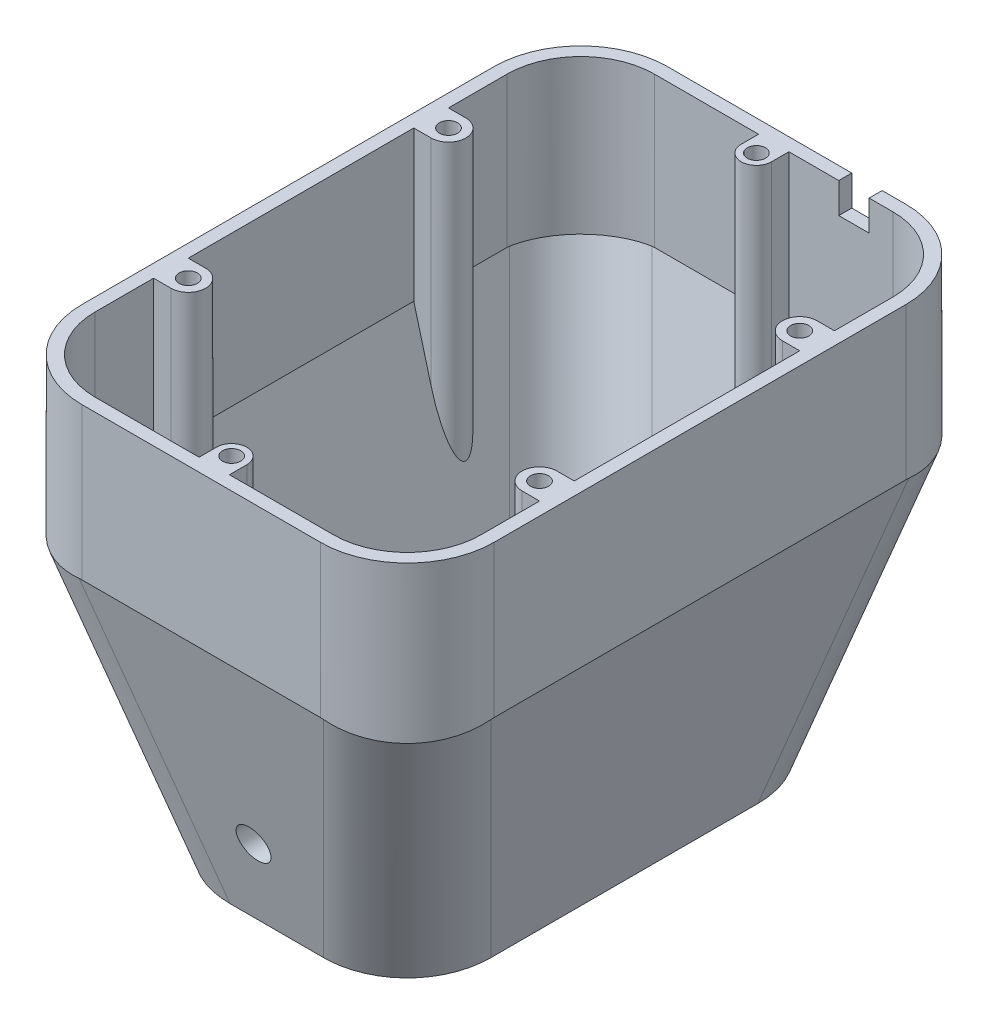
ISO-10303-21;
HEADER;
FILE_DESCRIPTION(('STEP AP214'),'2;1');
FILE_NAME('part.step','',(''),(''),'','','');
FILE_SCHEMA(('AUTOMOTIVE_DESIGN { 1 0 10303 214 1 1 1 1 }'));
ENDSEC;
DATA;
#1=APPLICATION_CONTEXT('core data for automotive mechanical design processes');
#2=APPLICATION_PROTOCOL_DEFINITION('international standard','automotive_design',2000,#1);
#3=PRODUCT_CONTEXT('',#1,'mechanical');
#4=PRODUCT('Part','Part','',(#3));
#5=PRODUCT_RELATED_PRODUCT_CATEGORY('part','',(#4));
#6=PRODUCT_DEFINITION_FORMATION('','',#4);
#7=PRODUCT_DEFINITION_CONTEXT('part definition',#1,'design');
#8=PRODUCT_DEFINITION('design','',#6,#7);
#9=PRODUCT_DEFINITION_SHAPE('','',#8);
#10=(LENGTH_UNIT() NAMED_UNIT(*) SI_UNIT(.MILLI.,.METRE.));
#11=(NAMED_UNIT(*) PLANE_ANGLE_UNIT() SI_UNIT($,.RADIAN.));
#12=(NAMED_UNIT(*) SI_UNIT($,.STERADIAN.) SOLID_ANGLE_UNIT());
#13=UNCERTAINTY_MEASURE_WITH_UNIT(LENGTH_MEASURE(1.E-05),#10,'distance_accuracy_value','');
#14=(GEOMETRIC_REPRESENTATION_CONTEXT(3) GLOBAL_UNCERTAINTY_ASSIGNED_CONTEXT((#13)) GLOBAL_UNIT_ASSIGNED_CONTEXT((#10,
#11,#12)) REPRESENTATION_CONTEXT('',''));
#15=CARTESIAN_POINT('',(0.,0.,0.));
#16=DIRECTION('',(0.,0.,1.));
#17=DIRECTION('',(1.,0.,0.));
#18=AXIS2_PLACEMENT_3D('',#15,#16,#17);
#19=CARTESIAN_POINT('',(0.,-62.,0.));
#20=DIRECTION('',(0.,-1.,0.));
#21=DIRECTION('',(0.,0.,-1.));
#22=AXIS2_PLACEMENT_3D('',#19,#20,#21);
#23=PLANE('',#22);
#24=CARTESIAN_POINT('',(0.,-62.,11.0994742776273));
#25=DIRECTION('',(0.,1.,0.));
#26=DIRECTION('',(0.,0.,1.));
#27=AXIS2_PLACEMENT_3D('',#24,#25,#26);
#28=CIRCLE('',#27,2.7);
#29=CARTESIAN_POINT('',(0.,-62.,13.7994742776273));
#30=VERTEX_POINT('',#29);
#31=EDGE_CURVE('E581',#30,#30,#28,.T.);
#32=ORIENTED_EDGE('',*,*,#31,.F.);
#33=EDGE_LOOP('',(#32));
#34=FACE_BOUND('',#33,.T.);
#35=CARTESIAN_POINT('',(0.,-62.,26.0994742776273));
#36=DIRECTION('',(0.,1.,0.));
#37=DIRECTION('',(0.,0.,1.));
#38=AXIS2_PLACEMENT_3D('',#35,#36,#37);
#39=CIRCLE('',#38,2.7);
#40=CARTESIAN_POINT('',(0.,-62.,28.7994742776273));
#41=VERTEX_POINT('',#40);
#42=EDGE_CURVE('E589',#41,#41,#39,.T.);
#43=ORIENTED_EDGE('',*,*,#42,.F.);
#44=EDGE_LOOP('',(#43));
#45=FACE_BOUND('',#44,.T.);
#46=DIRECTION('',(0.,0.,1.));
#47=VECTOR('',#46,1.);
#48=CARTESIAN_POINT('',(-6.,-62.,-77.2625524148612));
#49=LINE('',#48,#47);
#50=CARTESIAN_POINT('',(-6.00000000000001,-62.,-47.7813215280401));
#51=VERTEX_POINT('',#50);
#52=CARTESIAN_POINT('',(-6.,-62.,-15.5));
#53=VERTEX_POINT('',#52);
#54=EDGE_CURVE('E622',#51,#53,#49,.T.);
#55=ORIENTED_EDGE('',*,*,#54,.F.);
#56=DIRECTION('',(-1.,0.,0.));
#57=VECTOR('',#56,1.);
#58=CARTESIAN_POINT('',(-47.5,-62.,-47.7813215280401));
#59=LINE('',#58,#57);
#60=CARTESIAN_POINT('',(-11.3605824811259,-62.,-47.7813215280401));
#61=VERTEX_POINT('',#60);
#62=EDGE_CURVE('E847',#51,#61,#59,.T.);
#63=ORIENTED_EDGE('',*,*,#62,.T.);
#64=CARTESIAN_POINT('',(-10.1816264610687,-62.,-30.1816264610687));
#65=DIRECTION('',(0.,-1.,0.));
#66=DIRECTION('',(-0.707106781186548,0.,-0.707106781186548));
#67=AXIS2_PLACEMENT_3D('',#64,#65,#66);
#68=ELLIPSE('',#67,18.179618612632,17.);
#69=CARTESIAN_POINT('',(-27.7813215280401,-62.,-31.360582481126));
#70=VERTEX_POINT('',#69);
#71=EDGE_CURVE('E872',#70,#61,#68,.T.);
#72=ORIENTED_EDGE('',*,*,#71,.F.);
#73=DIRECTION('',(0.,0.,1.));
#74=VECTOR('',#73,1.);
#75=CARTESIAN_POINT('',(-27.7813215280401,-62.,67.5));
#76=LINE('',#75,#74);
#77=CARTESIAN_POINT('',(-27.7813215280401,-62.,31.360582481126));
#78=VERTEX_POINT('',#77);
#79=EDGE_CURVE('E868',#70,#78,#76,.T.);
#80=ORIENTED_EDGE('',*,*,#79,.T.);
#81=CARTESIAN_POINT('',(-10.1816264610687,-62.,30.1816264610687));
#82=DIRECTION('',(0.,-1.,0.));
#83=DIRECTION('',(-0.707106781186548,0.,0.707106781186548));
#84=AXIS2_PLACEMENT_3D('',#81,#82,#83);
#85=ELLIPSE('',#84,18.179618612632,17.);
#86=CARTESIAN_POINT('',(-11.3605824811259,-62.,47.7813215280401));
#87=VERTEX_POINT('',#86);
#88=EDGE_CURVE('E854',#87,#78,#85,.T.);
#89=ORIENTED_EDGE('',*,*,#88,.F.);
#90=DIRECTION('',(1.,0.,0.));
#91=VECTOR('',#90,1.);
#92=CARTESIAN_POINT('',(-47.5,-62.,47.7813215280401));
#93=LINE('',#92,#91);
#94=CARTESIAN_POINT('',(-6.00000000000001,-62.,47.7813215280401));
#95=VERTEX_POINT('',#94);
#96=EDGE_CURVE('E861',#87,#95,#93,.T.);
#97=ORIENTED_EDGE('',*,*,#96,.T.);
#98=DIRECTION('',(0.,0.,1.));
#99=VECTOR('',#98,1.);
#100=CARTESIAN_POINT('',(-6.,-62.,0.));
#101=LINE('',#100,#99);
#102=CARTESIAN_POINT('',(-6.,-62.,40.5));
#103=VERTEX_POINT('',#102);
#104=EDGE_CURVE('E133',#103,#95,#101,.T.);
#105=ORIENTED_EDGE('',*,*,#104,.F.);
#106=DIRECTION('',(-1.,0.,0.));
#107=VECTOR('',#106,1.);
#108=CARTESIAN_POINT('',(0.,-62.,40.5));
#109=LINE('',#108,#107);
#110=CARTESIAN_POINT('',(6.,-62.,40.5));
#111=VERTEX_POINT('',#110);
#112=EDGE_CURVE('E1095',#111,#103,#109,.T.);
#113=ORIENTED_EDGE('',*,*,#112,.F.);
#114=DIRECTION('',(0.,0.,-1.));
#115=VECTOR('',#114,1.);
#116=CARTESIAN_POINT('',(6.,-62.,0.));
#117=LINE('',#116,#115);
#118=CARTESIAN_POINT('',(5.99999999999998,-62.,47.7813215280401));
#119=VERTEX_POINT('',#118);
#120=EDGE_CURVE('E12',#119,#111,#117,.T.);
#121=ORIENTED_EDGE('',*,*,#120,.F.);
#122=CARTESIAN_POINT('',(11.3605824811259,-62.,47.7813215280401));
#123=VERTEX_POINT('',#122);
#124=EDGE_CURVE('E865',#119,#123,#93,.T.);
#125=ORIENTED_EDGE('',*,*,#124,.T.);
#126=CARTESIAN_POINT('',(10.1816264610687,-62.,30.1816264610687));
#127=DIRECTION('',(0.,-1.,0.));
#128=DIRECTION('',(0.707106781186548,0.,0.707106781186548));
#129=AXIS2_PLACEMENT_3D('',#126,#127,#128);
#130=ELLIPSE('',#129,18.179618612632,17.);
#131=CARTESIAN_POINT('',(27.7813215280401,-62.,31.3605824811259));
#132=VERTEX_POINT('',#131);
#133=EDGE_CURVE('E867',#132,#123,#130,.T.);
#134=ORIENTED_EDGE('',*,*,#133,.F.);
#135=DIRECTION('',(0.,0.,-1.));
#136=VECTOR('',#135,1.);
#137=CARTESIAN_POINT('',(27.7813215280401,-62.,67.5));
#138=LINE('',#137,#136);
#139=CARTESIAN_POINT('',(27.7813215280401,-62.,-31.3605824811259));
#140=VERTEX_POINT('',#139);
#141=EDGE_CURVE('E844',#132,#140,#138,.T.);
#142=ORIENTED_EDGE('',*,*,#141,.T.);
#143=CARTESIAN_POINT('',(10.1816264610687,-62.,-30.1816264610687));
#144=DIRECTION('',(0.,-1.,0.));
#145=DIRECTION('',(0.707106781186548,0.,-0.707106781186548));
#146=AXIS2_PLACEMENT_3D('',#143,#144,#145);
#147=ELLIPSE('',#146,18.179618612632,17.);
#148=CARTESIAN_POINT('',(11.360582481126,-62.,-47.7813215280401));
#149=VERTEX_POINT('',#148);
#150=EDGE_CURVE('E875',#149,#140,#147,.T.);
#151=ORIENTED_EDGE('',*,*,#150,.F.);
#152=CARTESIAN_POINT('',(5.99999999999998,-62.,-47.7813215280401));
#153=VERTEX_POINT('',#152);
#154=EDGE_CURVE('E871',#149,#153,#59,.T.);
#155=ORIENTED_EDGE('',*,*,#154,.T.);
#156=DIRECTION('',(0.,0.,1.));
#157=VECTOR('',#156,1.);
#158=CARTESIAN_POINT('',(6.,-62.,-77.2625524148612));
#159=LINE('',#158,#157);
#160=CARTESIAN_POINT('',(6.,-62.,-15.5));
#161=VERTEX_POINT('',#160);
#162=EDGE_CURVE('E148',#153,#161,#159,.T.);
#163=ORIENTED_EDGE('',*,*,#162,.T.);
#164=DIRECTION('',(-1.,0.,0.));
#165=VECTOR('',#164,1.);
#166=CARTESIAN_POINT('',(6.,-62.,-15.5));
#167=LINE('',#166,#165);
#168=EDGE_CURVE('E615',#161,#53,#167,.T.);
#169=ORIENTED_EDGE('',*,*,#168,.T.);
#170=EDGE_LOOP('',(#55,#63,#72,#80,#89,#97,#105,#113,#121,#125,#134,#142,#151,#155,#163,#169));
#171=FACE_BOUND('',#170,.T.);
#172=ADVANCED_FACE('F125',(#34,#45,#171),#23,.F.);
#173=CARTESIAN_POINT('',(-47.5,0.776457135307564,64.6022225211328));
#174=DIRECTION('',(0.,-0.258819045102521,0.965925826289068));
#175=DIRECTION('',(0.,-0.965925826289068,-0.258819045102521));
#176=AXIS2_PLACEMENT_3D('',#173,#174,#175);
#177=PLANE('',#176);
#178=DIRECTION('',(0.,0.965925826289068,0.258819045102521));
#179=VECTOR('',#178,1.);
#180=CARTESIAN_POINT('',(6.,-38.1837310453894,54.1628715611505));
#181=LINE('',#180,#179);
#182=CARTESIAN_POINT('',(6.,-45.,52.3364577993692));
#183=VERTEX_POINT('',#182);
#184=EDGE_CURVE('E628',#119,#183,#181,.T.);
#185=ORIENTED_EDGE('',*,*,#184,.T.);
#186=CARTESIAN_POINT('',(0.,-45.,52.3364577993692));
#187=DIRECTION('',(0.,-0.258819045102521,0.965925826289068));
#188=DIRECTION('',(0.,-0.965925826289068,-0.258819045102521));
#189=AXIS2_PLACEMENT_3D('',#186,#187,#188);
#190=ELLIPSE('',#189,6.2116570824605,6.);
#191=CARTESIAN_POINT('',(-6.,-45.,52.3364577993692));
#192=VERTEX_POINT('',#191);
#193=EDGE_CURVE('E634',#183,#192,#190,.T.);
#194=ORIENTED_EDGE('',*,*,#193,.T.);
#195=DIRECTION('',(0.,-0.965925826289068,-0.258819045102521));
#196=VECTOR('',#195,1.);
#197=CARTESIAN_POINT('',(-6.,-56.8439850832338,49.1628715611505));
#198=LINE('',#197,#196);
#199=EDGE_CURVE('E632',#192,#95,#198,.T.);
#200=ORIENTED_EDGE('',*,*,#199,.T.);
#201=ORIENTED_EDGE('',*,*,#96,.F.);
#202=DIRECTION('',(-0.250562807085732,0.935113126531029,0.250562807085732));
#203=VECTOR('',#202,1.);
#204=CARTESIAN_POINT('',(-29.3943331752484,5.30287384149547,65.8150722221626));
#205=LINE('',#204,#203);
#206=CARTESIAN_POINT('',(-28.0697120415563,0.359320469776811,64.4904510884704));
#207=VERTEX_POINT('',#206);
#208=EDGE_CURVE('E887',#207,#87,#205,.F.);
#209=ORIENTED_EDGE('',*,*,#208,.F.);
#210=CARTESIAN_POINT('',(-27.5,-63.0499062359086,47.5));
#211=DIRECTION('',(0.,-0.258819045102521,0.965925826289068));
#212=DIRECTION('',(0.,-0.965925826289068,-0.258819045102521));
#213=AXIS2_PLACEMENT_3D('',#210,#211,#212);
#214=ELLIPSE('',#213,65.6829561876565,17.);
#215=CARTESIAN_POINT('',(-27.5,0.394957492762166,64.5));
#216=VERTEX_POINT('',#215);
#217=EDGE_CURVE('E884',#216,#207,#214,.T.);
#218=ORIENTED_EDGE('',*,*,#217,.F.);
#219=DIRECTION('',(1.,0.,0.));
#220=VECTOR('',#219,1.);
#221=CARTESIAN_POINT('',(-47.5,0.394957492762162,64.5));
#222=LINE('',#221,#220);
#223=CARTESIAN_POINT('',(-3.5,0.394957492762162,64.5));
#224=VERTEX_POINT('',#223);
#225=EDGE_CURVE('E848',#216,#224,#222,.T.);
#226=ORIENTED_EDGE('',*,*,#225,.T.);
#227=DIRECTION('',(0.,-0.965925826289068,-0.258819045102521));
#228=VECTOR('',#227,1.);
#229=CARTESIAN_POINT('',(-3.49999999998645,-466507.324488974,-124935.866688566));
#230=LINE('',#229,#228);
#231=CARTESIAN_POINT('',(-3.5,-14.5332457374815,60.5000000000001));
#232=VERTEX_POINT('',#231);
#233=EDGE_CURVE('E678',#224,#232,#230,.T.);
#234=ORIENTED_EDGE('',*,*,#233,.T.);
#235=CARTESIAN_POINT('',(0.,-14.533245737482,60.5));
#236=DIRECTION('',(0.,-0.258819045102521,0.965925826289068));
#237=DIRECTION('',(0.,0.965925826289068,0.258819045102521));
#238=AXIS2_PLACEMENT_3D('',#235,#236,#237);
#239=ELLIPSE('',#238,13.5229615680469,3.5);
#240=CARTESIAN_POINT('',(3.5,-14.5332457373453,60.5000000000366));
#241=VERTEX_POINT('',#240);
#242=EDGE_CURVE('E679',#232,#241,#239,.T.);
#243=ORIENTED_EDGE('',*,*,#242,.T.);
#244=DIRECTION('',(0.,0.965925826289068,0.258819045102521));
#245=VECTOR('',#244,1.);
#246=CARTESIAN_POINT('',(3.49999999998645,-466506.324488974,-124935.598739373));
#247=LINE('',#246,#245);
#248=CARTESIAN_POINT('',(3.5,0.394957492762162,64.5));
#249=VERTEX_POINT('',#248);
#250=EDGE_CURVE('E675',#241,#249,#247,.T.);
#251=ORIENTED_EDGE('',*,*,#250,.T.);
#252=CARTESIAN_POINT('',(27.5,0.394957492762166,64.5));
#253=VERTEX_POINT('',#252);
#254=EDGE_CURVE('E883',#249,#253,#222,.T.);
#255=ORIENTED_EDGE('',*,*,#254,.T.);
#256=CARTESIAN_POINT('',(27.5,-63.0499062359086,47.5));
#257=DIRECTION('',(0.,-0.258819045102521,0.965925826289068));
#258=DIRECTION('',(0.,-0.965925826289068,-0.258819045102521));
#259=AXIS2_PLACEMENT_3D('',#256,#257,#258);
#260=ELLIPSE('',#259,65.6829561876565,17.);
#261=CARTESIAN_POINT('',(28.0697120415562,0.359320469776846,64.4904510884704));
#262=VERTEX_POINT('',#261);
#263=EDGE_CURVE('E892',#262,#253,#260,.T.);
#264=ORIENTED_EDGE('',*,*,#263,.F.);
#265=DIRECTION('',(0.250562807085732,0.935113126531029,0.250562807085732));
#266=VECTOR('',#265,1.);
#267=CARTESIAN_POINT('',(23.4300697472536,-16.9560603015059,59.8508087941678));
#268=LINE('',#267,#266);
#269=EDGE_CURVE('E889',#123,#262,#268,.T.);
#270=ORIENTED_EDGE('',*,*,#269,.F.);
#271=ORIENTED_EDGE('',*,*,#124,.F.);
#272=EDGE_LOOP('',(#185,#194,#200,#201,#209,#218,#226,#234,#243,#251,#255,#264,#270,#271));
#273=FACE_BOUND('',#272,.T.);
#274=ADVANCED_FACE('F1117',(#273),#177,.F.);
#275=CARTESIAN_POINT('',(-47.5,35.,64.5));
#276=DIRECTION('',(0.,0.,-1.));
#277=DIRECTION('',(-1.,0.,0.));
#278=AXIS2_PLACEMENT_3D('',#275,#276,#277);
#279=PLANE('',#278);
#280=ORIENTED_EDGE('',*,*,#254,.F.);
#281=DIRECTION('',(0.,1.,0.));
#282=VECTOR('',#281,1.);
#283=CARTESIAN_POINT('',(3.5,-500000.,64.5));
#284=LINE('',#283,#282);
#285=CARTESIAN_POINT('',(3.5,35.,64.5));
#286=VERTEX_POINT('',#285);
#287=EDGE_CURVE('E666',#249,#286,#284,.T.);
#288=ORIENTED_EDGE('',*,*,#287,.T.);
#289=DIRECTION('',(1.,0.,0.));
#290=VECTOR('',#289,1.);
#291=CARTESIAN_POINT('',(-47.5,35.,64.5));
#292=LINE('',#291,#290);
#293=CARTESIAN_POINT('',(27.5,35.,64.5));
#294=VERTEX_POINT('',#293);
#295=EDGE_CURVE('E912',#286,#294,#292,.T.);
#296=ORIENTED_EDGE('',*,*,#295,.T.);
#297=DIRECTION('',(0.,1.,0.));
#298=VECTOR('',#297,1.);
#299=CARTESIAN_POINT('',(27.5,35.,64.5));
#300=LINE('',#299,#298);
#301=EDGE_CURVE('E864',#253,#294,#300,.T.);
#302=ORIENTED_EDGE('',*,*,#301,.F.);
#303=EDGE_LOOP('',(#280,#288,#296,#302));
#304=FACE_BOUND('',#303,.T.);
#305=ADVANCED_FACE('F1204',(#304),#279,.T.);
#306=CARTESIAN_POINT('',(-27.5,35.,64.5));
#307=VERTEX_POINT('',#306);
#308=CARTESIAN_POINT('',(-3.5,35.,64.5));
#309=VERTEX_POINT('',#308);
#310=EDGE_CURVE('E952',#307,#309,#292,.T.);
#311=ORIENTED_EDGE('',*,*,#310,.T.);
#312=DIRECTION('',(0.,1.,0.));
#313=VECTOR('',#312,1.);
#314=CARTESIAN_POINT('',(-3.5,-500000.,64.5));
#315=LINE('',#314,#313);
#316=EDGE_CURVE('E669',#224,#309,#315,.T.);
#317=ORIENTED_EDGE('',*,*,#316,.F.);
#318=ORIENTED_EDGE('',*,*,#225,.F.);
#319=DIRECTION('',(0.,1.,0.));
#320=VECTOR('',#319,1.);
#321=CARTESIAN_POINT('',(-27.5,35.,64.5));
#322=LINE('',#321,#320);
#323=EDGE_CURVE('E895',#307,#216,#322,.F.);
#324=ORIENTED_EDGE('',*,*,#323,.F.);
#325=EDGE_LOOP('',(#311,#317,#318,#324));
#326=FACE_BOUND('',#325,.T.);
#327=ADVANCED_FACE('F1184',(#326),#279,.T.);
#328=CARTESIAN_POINT('',(47.5,35.,-64.5));
#329=DIRECTION('',(0.,0.,1.));
#330=DIRECTION('',(1.,0.,0.));
#331=AXIS2_PLACEMENT_3D('',#328,#329,#330);
#332=PLANE('',#331);
#333=DIRECTION('',(0.,1.,0.));
#334=VECTOR('',#333,1.);
#335=CARTESIAN_POINT('',(-3.5,-500000.,-64.5));
#336=LINE('',#335,#334);
#337=CARTESIAN_POINT('',(-3.5,0.394957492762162,-64.5));
#338=VERTEX_POINT('',#337);
#339=CARTESIAN_POINT('',(-3.5,35.,-64.5));
#340=VERTEX_POINT('',#339);
#341=EDGE_CURVE('E702',#338,#340,#336,.T.);
#342=ORIENTED_EDGE('',*,*,#341,.T.);
#343=DIRECTION('',(-1.,0.,0.));
#344=VECTOR('',#343,1.);
#345=CARTESIAN_POINT('',(47.5,35.,-64.5));
#346=LINE('',#345,#344);
#347=CARTESIAN_POINT('',(-27.5,35.,-64.5));
#348=VERTEX_POINT('',#347);
#349=EDGE_CURVE('E960',#340,#348,#346,.T.);
#350=ORIENTED_EDGE('',*,*,#349,.T.);
#351=DIRECTION('',(0.,1.,0.));
#352=VECTOR('',#351,1.);
#353=CARTESIAN_POINT('',(-27.5,35.,-64.5));
#354=LINE('',#353,#352);
#355=CARTESIAN_POINT('',(-27.5,0.394957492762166,-64.5));
#356=VERTEX_POINT('',#355);
#357=EDGE_CURVE('E925',#356,#348,#354,.T.);
#358=ORIENTED_EDGE('',*,*,#357,.F.);
#359=DIRECTION('',(-1.,0.,0.));
#360=VECTOR('',#359,1.);
#361=CARTESIAN_POINT('',(-47.5,0.394957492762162,-64.5));
#362=LINE('',#361,#360);
#363=EDGE_CURVE('E858',#338,#356,#362,.T.);
#364=ORIENTED_EDGE('',*,*,#363,.F.);
#365=EDGE_LOOP('',(#342,#350,#358,#364));
#366=FACE_BOUND('',#365,.T.);
#367=ADVANCED_FACE('F1260',(#366),#332,.T.);
#368=CARTESIAN_POINT('',(44.5,35.,67.5));
#369=DIRECTION('',(-1.,0.,0.));
#370=DIRECTION('',(0.,0.,1.));
#371=AXIS2_PLACEMENT_3D('',#368,#369,#370);
#372=PLANE('',#371);
#373=DIRECTION('',(0.,1.,0.));
#374=VECTOR('',#373,1.);
#375=CARTESIAN_POINT('',(44.5,-500000.,26.));
#376=LINE('',#375,#374);
#377=CARTESIAN_POINT('',(44.5,0.394957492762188,26.));
#378=VERTEX_POINT('',#377);
#379=CARTESIAN_POINT('',(44.5,35.,26.));
#380=VERTEX_POINT('',#379);
#381=EDGE_CURVE('E742',#378,#380,#376,.T.);
#382=ORIENTED_EDGE('',*,*,#381,.T.);
#383=DIRECTION('',(0.,0.,-1.));
#384=VECTOR('',#383,1.);
#385=CARTESIAN_POINT('',(44.5,35.,67.5));
#386=LINE('',#385,#384);
#387=CARTESIAN_POINT('',(44.5,35.,-26.));
#388=VERTEX_POINT('',#387);
#389=EDGE_CURVE('E961',#380,#388,#386,.T.);
#390=ORIENTED_EDGE('',*,*,#389,.T.);
#391=DIRECTION('',(0.,1.,0.));
#392=VECTOR('',#391,1.);
#393=CARTESIAN_POINT('',(44.5,-500000.,-26.));
#394=LINE('',#393,#392);
#395=CARTESIAN_POINT('',(44.5,0.394957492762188,-26.));
#396=VERTEX_POINT('',#395);
#397=EDGE_CURVE('E792',#396,#388,#394,.T.);
#398=ORIENTED_EDGE('',*,*,#397,.F.);
#399=DIRECTION('',(0.,0.,-1.));
#400=VECTOR('',#399,1.);
#401=CARTESIAN_POINT('',(44.5,0.394957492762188,67.5));
#402=LINE('',#401,#400);
#403=EDGE_CURVE('E859',#378,#396,#402,.T.);
#404=ORIENTED_EDGE('',*,*,#403,.F.);
#405=EDGE_LOOP('',(#382,#390,#398,#404));
#406=FACE_BOUND('',#405,.T.);
#407=ADVANCED_FACE('F1226',(#406),#372,.T.);
#408=CARTESIAN_POINT('',(-44.5,35.,-67.5));
#409=DIRECTION('',(1.,0.,0.));
#410=DIRECTION('',(0.,0.,-1.));
#411=AXIS2_PLACEMENT_3D('',#408,#409,#410);
#412=PLANE('',#411);
#413=DIRECTION('',(0.,0.,1.));
#414=VECTOR('',#413,1.);
#415=CARTESIAN_POINT('',(-44.5,0.394957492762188,67.5));
#416=LINE('',#415,#414);
#417=CARTESIAN_POINT('',(-44.5,0.394957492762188,34.));
#418=VERTEX_POINT('',#417);
#419=CARTESIAN_POINT('',(-44.5,0.394957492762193,47.5));
#420=VERTEX_POINT('',#419);
#421=EDGE_CURVE('E920',#418,#420,#416,.T.);
#422=ORIENTED_EDGE('',*,*,#421,.F.);
#423=DIRECTION('',(0.,1.,0.));
#424=VECTOR('',#423,1.);
#425=CARTESIAN_POINT('',(-44.5,-500000.,34.));
#426=LINE('',#425,#424);
#427=CARTESIAN_POINT('',(-44.5,35.,34.));
#428=VERTEX_POINT('',#427);
#429=EDGE_CURVE('E769',#418,#428,#426,.T.);
#430=ORIENTED_EDGE('',*,*,#429,.T.);
#431=DIRECTION('',(0.,0.,1.));
#432=VECTOR('',#431,1.);
#433=CARTESIAN_POINT('',(-44.5,35.,-67.5));
#434=LINE('',#433,#432);
#435=CARTESIAN_POINT('',(-44.5,35.,47.5));
#436=VERTEX_POINT('',#435);
#437=EDGE_CURVE('E966',#428,#436,#434,.T.);
#438=ORIENTED_EDGE('',*,*,#437,.T.);
#439=DIRECTION('',(0.,1.,0.));
#440=VECTOR('',#439,1.);
#441=CARTESIAN_POINT('',(-44.5,35.,47.5));
#442=LINE('',#441,#440);
#443=EDGE_CURVE('E900',#420,#436,#442,.T.);
#444=ORIENTED_EDGE('',*,*,#443,.F.);
#445=EDGE_LOOP('',(#422,#430,#438,#444));
#446=FACE_BOUND('',#445,.T.);
#447=ADVANCED_FACE('F1290',(#446),#412,.T.);
#448=CARTESIAN_POINT('',(-44.5,35.,-26.));
#449=VERTEX_POINT('',#448);
#450=CARTESIAN_POINT('',(-44.5,35.,26.));
#451=VERTEX_POINT('',#450);
#452=EDGE_CURVE('E971',#449,#451,#434,.T.);
#453=ORIENTED_EDGE('',*,*,#452,.T.);
#454=DIRECTION('',(0.,1.,0.));
#455=VECTOR('',#454,1.);
#456=CARTESIAN_POINT('',(-44.5,-500000.,26.));
#457=LINE('',#456,#455);
#458=CARTESIAN_POINT('',(-44.5,0.394957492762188,26.));
#459=VERTEX_POINT('',#458);
#460=EDGE_CURVE('E766',#459,#451,#457,.T.);
#461=ORIENTED_EDGE('',*,*,#460,.F.);
#462=CARTESIAN_POINT('',(-44.5,0.394957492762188,-26.));
#463=VERTEX_POINT('',#462);
#464=EDGE_CURVE('E919',#463,#459,#416,.T.);
#465=ORIENTED_EDGE('',*,*,#464,.F.);
#466=DIRECTION('',(0.,1.,0.));
#467=VECTOR('',#466,1.);
#468=CARTESIAN_POINT('',(-44.5,-500000.,-26.));
#469=LINE('',#468,#467);
#470=EDGE_CURVE('E825',#463,#449,#469,.T.);
#471=ORIENTED_EDGE('',*,*,#470,.T.);
#472=EDGE_LOOP('',(#453,#461,#465,#471));
#473=FACE_BOUND('',#472,.T.);
#474=ADVANCED_FACE('F1283',(#473),#412,.T.);
#475=CARTESIAN_POINT('',(-44.6022225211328,0.776457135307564,67.5));
#476=DIRECTION('',(-0.965925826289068,-0.258819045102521,0.));
#477=DIRECTION('',(0.258819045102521,-0.965925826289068,0.));
#478=AXIS2_PLACEMENT_3D('',#475,#476,#477);
#479=PLANE('',#478);
#480=DIRECTION('',(-0.258819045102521,0.965925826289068,0.));
#481=VECTOR('',#480,1.);
#482=CARTESIAN_POINT('',(124955.598739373,-466506.324488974,34.));
#483=LINE('',#482,#481);
#484=CARTESIAN_POINT('',(-40.5000000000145,-14.5332457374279,34.));
#485=VERTEX_POINT('',#484);
#486=EDGE_CURVE('E734',#485,#418,#483,.T.);
#487=ORIENTED_EDGE('',*,*,#486,.T.);
#488=ORIENTED_EDGE('',*,*,#421,.T.);
#489=CARTESIAN_POINT('',(-27.5,-63.0499062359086,47.5));
#490=DIRECTION('',(-0.965925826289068,-0.258819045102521,0.));
#491=DIRECTION('',(0.258819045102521,-0.965925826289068,0.));
#492=AXIS2_PLACEMENT_3D('',#489,#490,#491);
#493=ELLIPSE('',#492,65.6829561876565,17.);
#494=CARTESIAN_POINT('',(-44.4904510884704,0.359320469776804,48.0697120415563));
#495=VERTEX_POINT('',#494);
#496=EDGE_CURVE('E905',#495,#420,#493,.T.);
#497=ORIENTED_EDGE('',*,*,#496,.F.);
#498=DIRECTION('',(-0.250562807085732,0.935113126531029,0.250562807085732));
#499=VECTOR('',#498,1.);
#500=CARTESIAN_POINT('',(-45.8150722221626,5.30287384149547,49.3943331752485));
#501=LINE('',#500,#499);
#502=EDGE_CURVE('E908',#78,#495,#501,.T.);
#503=ORIENTED_EDGE('',*,*,#502,.F.);
#504=ORIENTED_EDGE('',*,*,#79,.F.);
#505=DIRECTION('',(-0.250562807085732,0.935113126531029,-0.250562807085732));
#506=VECTOR('',#505,1.);
#507=CARTESIAN_POINT('',(-45.8150722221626,5.30287384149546,-49.3943331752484));
#508=LINE('',#507,#506);
#509=CARTESIAN_POINT('',(-44.4904510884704,0.359320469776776,-48.0697120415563));
#510=VERTEX_POINT('',#509);
#511=EDGE_CURVE('E886',#510,#70,#508,.F.);
#512=ORIENTED_EDGE('',*,*,#511,.F.);
#513=CARTESIAN_POINT('',(-27.5,-63.0499062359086,-47.5));
#514=DIRECTION('',(-0.965925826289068,-0.258819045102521,0.));
#515=DIRECTION('',(0.258819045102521,-0.965925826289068,0.));
#516=AXIS2_PLACEMENT_3D('',#513,#514,#515);
#517=ELLIPSE('',#516,65.6829561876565,17.);
#518=CARTESIAN_POINT('',(-44.5,0.394957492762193,-47.5));
#519=VERTEX_POINT('',#518);
#520=EDGE_CURVE('E915',#519,#510,#517,.T.);
#521=ORIENTED_EDGE('',*,*,#520,.F.);
#522=CARTESIAN_POINT('',(-44.5,0.394957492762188,-34.));
#523=VERTEX_POINT('',#522);
#524=EDGE_CURVE('E916',#519,#523,#416,.T.);
#525=ORIENTED_EDGE('',*,*,#524,.T.);
#526=DIRECTION('',(-0.258819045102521,0.965925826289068,0.));
#527=VECTOR('',#526,1.);
#528=CARTESIAN_POINT('',(124955.598739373,-466506.324488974,-34.));
#529=LINE('',#528,#527);
#530=CARTESIAN_POINT('',(-40.5000000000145,-14.5332457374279,-34.));
#531=VERTEX_POINT('',#530);
#532=EDGE_CURVE('E831',#531,#523,#529,.T.);
#533=ORIENTED_EDGE('',*,*,#532,.F.);
#534=CARTESIAN_POINT('',(-40.5,-14.533245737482,-30.));
#535=DIRECTION('',(-0.965925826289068,-0.258819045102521,0.));
#536=DIRECTION('',(-0.258819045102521,0.965925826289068,0.));
#537=AXIS2_PLACEMENT_3D('',#534,#535,#536);
#538=ELLIPSE('',#537,15.4548132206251,4.00000000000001);
#539=CARTESIAN_POINT('',(-40.5,-14.533245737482,-26.));
#540=VERTEX_POINT('',#539);
#541=EDGE_CURVE('E832',#540,#531,#538,.F.);
#542=ORIENTED_EDGE('',*,*,#541,.F.);
#543=DIRECTION('',(0.258819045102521,-0.965925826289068,0.));
#544=VECTOR('',#543,1.);
#545=CARTESIAN_POINT('',(124955.866688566,-466507.324488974,-26.0000000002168));
#546=LINE('',#545,#544);
#547=EDGE_CURVE('E821',#463,#540,#546,.T.);
#548=ORIENTED_EDGE('',*,*,#547,.F.);
#549=ORIENTED_EDGE('',*,*,#464,.T.);
#550=DIRECTION('',(0.258819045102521,-0.965925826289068,0.));
#551=VECTOR('',#550,1.);
#552=CARTESIAN_POINT('',(124955.866688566,-466507.324488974,26.0000000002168));
#553=LINE('',#552,#551);
#554=CARTESIAN_POINT('',(-40.4999999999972,-14.533245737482,26.));
#555=VERTEX_POINT('',#554);
#556=EDGE_CURVE('E773',#459,#555,#553,.T.);
#557=ORIENTED_EDGE('',*,*,#556,.T.);
#558=CARTESIAN_POINT('',(-40.5,-14.533245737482,30.));
#559=DIRECTION('',(-0.965925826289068,-0.258819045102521,0.));
#560=DIRECTION('',(-0.258819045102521,0.965925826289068,0.));
#561=AXIS2_PLACEMENT_3D('',#558,#559,#560);
#562=ELLIPSE('',#561,15.4548132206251,4.00000000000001);
#563=EDGE_CURVE('E750',#555,#485,#562,.T.);
#564=ORIENTED_EDGE('',*,*,#563,.T.);
#565=EDGE_LOOP('',(#487,#488,#497,#503,#504,#512,#521,#525,#533,#542,#548,#549,#557,#564));
#566=FACE_BOUND('',#565,.T.);
#567=ADVANCED_FACE('F1170',(#566),#479,.F.);
#568=CARTESIAN_POINT('',(44.6022225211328,0.776457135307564,67.5));
#569=DIRECTION('',(0.965925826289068,-0.258819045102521,0.));
#570=DIRECTION('',(0.258819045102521,0.965925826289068,0.));
#571=AXIS2_PLACEMENT_3D('',#568,#569,#570);
#572=PLANE('',#571);
#573=CARTESIAN_POINT('',(40.5,-14.533245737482,30.));
#574=DIRECTION('',(0.965925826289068,-0.258819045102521,0.));
#575=DIRECTION('',(0.258819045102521,0.965925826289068,0.));
#576=AXIS2_PLACEMENT_3D('',#573,#574,#575);
#577=ELLIPSE('',#576,15.4548132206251,4.00000000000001);
#578=CARTESIAN_POINT('',(40.5,-14.533245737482,26.));
#579=VERTEX_POINT('',#578);
#580=CARTESIAN_POINT('',(40.5000000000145,-14.5332457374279,34.));
#581=VERTEX_POINT('',#580);
#582=EDGE_CURVE('E712',#579,#581,#577,.F.);
#583=ORIENTED_EDGE('',*,*,#582,.F.);
#584=DIRECTION('',(-0.258819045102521,-0.965925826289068,0.));
#585=VECTOR('',#584,1.);
#586=CARTESIAN_POINT('',(-124955.866688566,-466507.324488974,26.0000000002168));
#587=LINE('',#586,#585);
#588=EDGE_CURVE('E718',#378,#579,#587,.T.);
#589=ORIENTED_EDGE('',*,*,#588,.F.);
#590=ORIENTED_EDGE('',*,*,#403,.T.);
#591=DIRECTION('',(-0.258819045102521,-0.965925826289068,0.));
#592=VECTOR('',#591,1.);
#593=CARTESIAN_POINT('',(-124955.866688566,-466507.324488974,-26.0000000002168));
#594=LINE('',#593,#592);
#595=CARTESIAN_POINT('',(40.4999999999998,-14.5332457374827,-26.));
#596=VERTEX_POINT('',#595);
#597=EDGE_CURVE('E801',#396,#596,#594,.T.);
#598=ORIENTED_EDGE('',*,*,#597,.T.);
#599=CARTESIAN_POINT('',(40.5,-14.533245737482,-30.));
#600=DIRECTION('',(0.965925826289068,-0.258819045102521,0.));
#601=DIRECTION('',(0.258819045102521,0.965925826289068,0.));
#602=AXIS2_PLACEMENT_3D('',#599,#600,#601);
#603=ELLIPSE('',#602,15.4548132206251,4.00000000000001);
#604=CARTESIAN_POINT('',(40.5000000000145,-14.5332457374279,-34.));
#605=VERTEX_POINT('',#604);
#606=EDGE_CURVE('E802',#596,#605,#603,.T.);
#607=ORIENTED_EDGE('',*,*,#606,.T.);
#608=DIRECTION('',(0.258819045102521,0.965925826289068,0.));
#609=VECTOR('',#608,1.);
#610=CARTESIAN_POINT('',(-124955.598739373,-466506.324488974,-34.));
#611=LINE('',#610,#609);
#612=CARTESIAN_POINT('',(44.5,0.394957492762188,-34.));
#613=VERTEX_POINT('',#612);
#614=EDGE_CURVE('E798',#605,#613,#611,.T.);
#615=ORIENTED_EDGE('',*,*,#614,.T.);
#616=CARTESIAN_POINT('',(44.5,0.394957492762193,-47.5));
#617=VERTEX_POINT('',#616);
#618=EDGE_CURVE('E860',#613,#617,#402,.T.);
#619=ORIENTED_EDGE('',*,*,#618,.T.);
#620=CARTESIAN_POINT('',(27.5,-63.0499062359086,-47.5));
#621=DIRECTION('',(0.965925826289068,-0.258819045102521,0.));
#622=DIRECTION('',(-0.258819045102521,-0.965925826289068,0.));
#623=AXIS2_PLACEMENT_3D('',#620,#621,#622);
#624=ELLIPSE('',#623,65.6829561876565,17.);
#625=CARTESIAN_POINT('',(44.4904510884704,0.359320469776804,-48.0697120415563));
#626=VERTEX_POINT('',#625);
#627=EDGE_CURVE('E851',#626,#617,#624,.T.);
#628=ORIENTED_EDGE('',*,*,#627,.F.);
#629=DIRECTION('',(0.250562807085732,0.935113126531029,-0.250562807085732));
#630=VECTOR('',#629,1.);
#631=CARTESIAN_POINT('',(37.3395399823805,-26.3282430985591,-40.9188009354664));
#632=LINE('',#631,#630);
#633=EDGE_CURVE('E841',#140,#626,#632,.T.);
#634=ORIENTED_EDGE('',*,*,#633,.F.);
#635=ORIENTED_EDGE('',*,*,#141,.F.);
#636=DIRECTION('',(0.250562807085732,0.935113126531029,0.250562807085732));
#637=VECTOR('',#636,1.);
#638=CARTESIAN_POINT('',(39.8508087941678,-16.9560603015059,43.4300697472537));
#639=LINE('',#638,#637);
#640=CARTESIAN_POINT('',(44.4904510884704,0.359320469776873,48.0697120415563));
#641=VERTEX_POINT('',#640);
#642=EDGE_CURVE('E840',#641,#132,#639,.F.);
#643=ORIENTED_EDGE('',*,*,#642,.F.);
#644=CARTESIAN_POINT('',(27.5,-63.0499062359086,47.5));
#645=DIRECTION('',(0.965925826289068,-0.258819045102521,0.));
#646=DIRECTION('',(-0.258819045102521,-0.965925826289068,0.));
#647=AXIS2_PLACEMENT_3D('',#644,#645,#646);
#648=ELLIPSE('',#647,65.6829561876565,17.);
#649=CARTESIAN_POINT('',(44.5,0.394957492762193,47.5));
#650=VERTEX_POINT('',#649);
#651=EDGE_CURVE('E838',#650,#641,#648,.T.);
#652=ORIENTED_EDGE('',*,*,#651,.F.);
#653=CARTESIAN_POINT('',(44.5,0.394957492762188,34.));
#654=VERTEX_POINT('',#653);
#655=EDGE_CURVE('E855',#650,#654,#402,.T.);
#656=ORIENTED_EDGE('',*,*,#655,.T.);
#657=DIRECTION('',(0.258819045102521,0.965925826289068,0.));
#658=VECTOR('',#657,1.);
#659=CARTESIAN_POINT('',(-124955.598739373,-466506.324488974,34.));
#660=LINE('',#659,#658);
#661=EDGE_CURVE('E715',#581,#654,#660,.T.);
#662=ORIENTED_EDGE('',*,*,#661,.F.);
#663=EDGE_LOOP('',(#583,#589,#590,#598,#607,#615,#619,#628,#634,#635,#643,#652,#656,#662));
#664=FACE_BOUND('',#663,.T.);
#665=ADVANCED_FACE('F1130',(#664),#572,.F.);
#666=ORIENTED_EDGE('',*,*,#618,.F.);
#667=DIRECTION('',(0.,1.,0.));
#668=VECTOR('',#667,1.);
#669=CARTESIAN_POINT('',(44.5,-500000.,-34.));
#670=LINE('',#669,#668);
#671=CARTESIAN_POINT('',(44.5,35.,-34.));
#672=VERTEX_POINT('',#671);
#673=EDGE_CURVE('E789',#613,#672,#670,.T.);
#674=ORIENTED_EDGE('',*,*,#673,.T.);
#675=CARTESIAN_POINT('',(44.5,35.,-47.5));
#676=VERTEX_POINT('',#675);
#677=EDGE_CURVE('E954',#672,#676,#386,.T.);
#678=ORIENTED_EDGE('',*,*,#677,.T.);
#679=DIRECTION('',(0.,1.,0.));
#680=VECTOR('',#679,1.);
#681=CARTESIAN_POINT('',(44.5,35.,-47.5));
#682=LINE('',#681,#680);
#683=EDGE_CURVE('E843',#617,#676,#682,.T.);
#684=ORIENTED_EDGE('',*,*,#683,.F.);
#685=EDGE_LOOP('',(#666,#674,#678,#684));
#686=FACE_BOUND('',#685,.T.);
#687=ADVANCED_FACE('F1237',(#686),#372,.T.);
#688=DIRECTION('',(0.,1.,0.));
#689=VECTOR('',#688,1.);
#690=CARTESIAN_POINT('',(44.5,-500000.,34.));
#691=LINE('',#690,#689);
#692=CARTESIAN_POINT('',(44.5,35.,34.));
#693=VERTEX_POINT('',#692);
#694=EDGE_CURVE('E739',#654,#693,#691,.T.);
#695=ORIENTED_EDGE('',*,*,#694,.F.);
#696=ORIENTED_EDGE('',*,*,#655,.F.);
#697=DIRECTION('',(0.,1.,0.));
#698=VECTOR('',#697,1.);
#699=CARTESIAN_POINT('',(44.5,35.,47.5));
#700=LINE('',#699,#698);
#701=CARTESIAN_POINT('',(44.5,35.,47.5));
#702=VERTEX_POINT('',#701);
#703=EDGE_CURVE('E941',#702,#650,#700,.F.);
#704=ORIENTED_EDGE('',*,*,#703,.F.);
#705=EDGE_CURVE('E958',#702,#693,#386,.T.);
#706=ORIENTED_EDGE('',*,*,#705,.T.);
#707=EDGE_LOOP('',(#695,#696,#704,#706));
#708=FACE_BOUND('',#707,.T.);
#709=ADVANCED_FACE('F1335',(#708),#372,.T.);
#710=CARTESIAN_POINT('',(47.5,0.,67.5));
#711=DIRECTION('',(0.965925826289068,-0.258819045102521,0.));
#712=DIRECTION('',(0.258819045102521,0.965925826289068,0.));
#713=AXIS2_PLACEMENT_3D('',#710,#711,#712);
#714=PLANE('',#713);
#715=CARTESIAN_POINT('',(27.5,-74.6410161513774,47.5));
#716=DIRECTION('',(0.965925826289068,-0.258819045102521,0.));
#717=DIRECTION('',(-0.258819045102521,-0.965925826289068,0.));
#718=AXIS2_PLACEMENT_3D('',#715,#716,#717);
#719=ELLIPSE('',#718,77.2740661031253,20.);
#720=CARTESIAN_POINT('',(47.5,0.,47.5));
#721=VERTEX_POINT('',#720);
#722=CARTESIAN_POINT('',(47.4887659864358,-0.0419259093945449,48.1702494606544));
#723=VERTEX_POINT('',#722);
#724=EDGE_CURVE('E1058',#721,#723,#719,.T.);
#725=ORIENTED_EDGE('',*,*,#724,.T.);
#726=DIRECTION('',(0.250562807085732,0.935113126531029,0.250562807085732));
#727=VECTOR('',#726,1.);
#728=CARTESIAN_POINT('',(48.7128497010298,4.5264167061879,49.3943331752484));
#729=LINE('',#728,#727);
#730=CARTESIAN_POINT('',(30.083302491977,-65.,30.7647859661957));
#731=VERTEX_POINT('',#730);
#732=EDGE_CURVE('E1060',#723,#731,#729,.F.);
#733=ORIENTED_EDGE('',*,*,#732,.T.);
#734=DIRECTION('',(0.,0.,-1.));
#735=VECTOR('',#734,1.);
#736=CARTESIAN_POINT('',(30.083302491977,-65.,67.5));
#737=LINE('',#736,#735);
#738=CARTESIAN_POINT('',(30.083302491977,-65.,-30.7647859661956));
#739=VERTEX_POINT('',#738);
#740=EDGE_CURVE('E998',#731,#739,#737,.T.);
#741=ORIENTED_EDGE('',*,*,#740,.T.);
#742=DIRECTION('',(0.250562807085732,0.935113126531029,-0.250562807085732));
#743=VECTOR('',#742,1.);
#744=CARTESIAN_POINT('',(40.2373174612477,-27.1047002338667,-40.9188009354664));
#745=LINE('',#744,#743);
#746=CARTESIAN_POINT('',(47.4887659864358,-0.041925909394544,-48.1702494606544));
#747=VERTEX_POINT('',#746);
#748=EDGE_CURVE('E1055',#739,#747,#745,.T.);
#749=ORIENTED_EDGE('',*,*,#748,.T.);
#750=CARTESIAN_POINT('',(27.5,-74.6410161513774,-47.5));
#751=DIRECTION('',(0.965925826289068,-0.258819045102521,0.));
#752=DIRECTION('',(-0.258819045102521,-0.965925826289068,0.));
#753=AXIS2_PLACEMENT_3D('',#750,#751,#752);
#754=ELLIPSE('',#753,77.2740661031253,20.);
#755=CARTESIAN_POINT('',(47.5,0.,-47.5));
#756=VERTEX_POINT('',#755);
#757=EDGE_CURVE('E1053',#747,#756,#754,.T.);
#758=ORIENTED_EDGE('',*,*,#757,.T.);
#759=DIRECTION('',(0.,0.,-1.));
#760=VECTOR('',#759,1.);
#761=CARTESIAN_POINT('',(47.5,0.,67.5));
#762=LINE('',#761,#760);
#763=EDGE_CURVE('E986',#721,#756,#762,.T.);
#764=ORIENTED_EDGE('',*,*,#763,.F.);
#765=EDGE_LOOP('',(#725,#733,#741,#749,#758,#764));
#766=FACE_BOUND('',#765,.T.);
#767=ADVANCED_FACE('F1379',(#766),#714,.T.);
#768=CARTESIAN_POINT('',(-47.5,0.,67.5));
#769=DIRECTION('',(0.,-0.258819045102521,0.965925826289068));
#770=DIRECTION('',(0.,-0.965925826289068,-0.258819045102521));
#771=AXIS2_PLACEMENT_3D('',#768,#769,#770);
#772=PLANE('',#771);
#773=CARTESIAN_POINT('',(0.,-45.,55.4422863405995));
#774=DIRECTION('',(0.,-0.258819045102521,0.965925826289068));
#775=DIRECTION('',(0.,0.965925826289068,0.258819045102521));
#776=AXIS2_PLACEMENT_3D('',#773,#774,#775);
#777=ELLIPSE('',#776,4.03757710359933,3.9);
#778=CARTESIAN_POINT('',(0.,-41.1,56.4872881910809));
#779=VERTEX_POINT('',#778);
#780=EDGE_CURVE('E595',#779,#779,#777,.T.);
#781=ORIENTED_EDGE('',*,*,#780,.F.);
#782=EDGE_LOOP('',(#781));
#783=FACE_BOUND('',#782,.T.);
#784=DIRECTION('',(1.,0.,0.));
#785=VECTOR('',#784,1.);
#786=CARTESIAN_POINT('',(-47.5,0.,67.5));
#787=LINE('',#786,#785);
#788=CARTESIAN_POINT('',(-27.5,0.,67.5));
#789=VERTEX_POINT('',#788);
#790=CARTESIAN_POINT('',(27.5,0.,67.5));
#791=VERTEX_POINT('',#790);
#792=EDGE_CURVE('E995',#789,#791,#787,.T.);
#793=ORIENTED_EDGE('',*,*,#792,.F.);
#794=CARTESIAN_POINT('',(-27.5,-74.6410161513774,47.5));
#795=DIRECTION('',(0.,-0.258819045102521,0.965925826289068));
#796=DIRECTION('',(0.,-0.965925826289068,-0.258819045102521));
#797=AXIS2_PLACEMENT_3D('',#794,#795,#796);
#798=ELLIPSE('',#797,77.2740661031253,20.);
#799=CARTESIAN_POINT('',(-28.1702494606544,-0.0419259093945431,67.4887659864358));
#800=VERTEX_POINT('',#799);
#801=EDGE_CURVE('E1022',#789,#800,#798,.T.);
#802=ORIENTED_EDGE('',*,*,#801,.T.);
#803=DIRECTION('',(-0.250562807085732,0.935113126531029,0.250562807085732));
#804=VECTOR('',#803,1.);
#805=CARTESIAN_POINT('',(-29.3943331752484,4.5264167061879,68.7128497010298));
#806=LINE('',#805,#804);
#807=CARTESIAN_POINT('',(-10.7647859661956,-65.,50.083302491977));
#808=VERTEX_POINT('',#807);
#809=EDGE_CURVE('E1020',#800,#808,#806,.F.);
#810=ORIENTED_EDGE('',*,*,#809,.T.);
#811=DIRECTION('',(1.,0.,0.));
#812=VECTOR('',#811,1.);
#813=CARTESIAN_POINT('',(-47.5,-65.,50.083302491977));
#814=LINE('',#813,#812);
#815=CARTESIAN_POINT('',(10.7647859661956,-65.,50.083302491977));
#816=VERTEX_POINT('',#815);
#817=EDGE_CURVE('E1002',#808,#816,#814,.T.);
#818=ORIENTED_EDGE('',*,*,#817,.T.);
#819=DIRECTION('',(0.250562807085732,0.935113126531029,0.250562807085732));
#820=VECTOR('',#819,1.);
#821=CARTESIAN_POINT('',(23.4300697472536,-17.7325174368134,62.748586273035));
#822=LINE('',#821,#820);
#823=CARTESIAN_POINT('',(28.1702494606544,-0.0419259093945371,67.4887659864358));
#824=VERTEX_POINT('',#823);
#825=EDGE_CURVE('E1017',#816,#824,#822,.T.);
#826=ORIENTED_EDGE('',*,*,#825,.T.);
#827=CARTESIAN_POINT('',(27.5,-74.6410161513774,47.5));
#828=DIRECTION('',(0.,-0.258819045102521,0.965925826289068));
#829=DIRECTION('',(0.,-0.965925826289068,-0.258819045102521));
#830=AXIS2_PLACEMENT_3D('',#827,#828,#829);
#831=ELLIPSE('',#830,77.2740661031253,20.);
#832=EDGE_CURVE('E1015',#824,#791,#831,.T.);
#833=ORIENTED_EDGE('',*,*,#832,.T.);
#834=EDGE_LOOP('',(#793,#802,#810,#818,#826,#833));
#835=FACE_BOUND('',#834,.T.);
#836=ADVANCED_FACE('F1382',(#783,#835),#772,.T.);
#837=CARTESIAN_POINT('',(-47.5,0.,67.5));
#838=DIRECTION('',(-0.965925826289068,-0.258819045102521,0.));
#839=DIRECTION('',(0.258819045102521,-0.965925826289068,0.));
#840=AXIS2_PLACEMENT_3D('',#837,#838,#839);
#841=PLANE('',#840);
#842=DIRECTION('',(-0.250562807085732,0.935113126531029,0.250562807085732));
#843=VECTOR('',#842,1.);
#844=CARTESIAN_POINT('',(-48.7128497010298,4.5264167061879,49.3943331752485));
#845=LINE('',#844,#843);
#846=CARTESIAN_POINT('',(-30.083302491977,-65.,30.7647859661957));
#847=VERTEX_POINT('',#846);
#848=CARTESIAN_POINT('',(-47.4887659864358,-0.0419259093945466,48.1702494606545));
#849=VERTEX_POINT('',#848);
#850=EDGE_CURVE('E1028',#847,#849,#845,.T.);
#851=ORIENTED_EDGE('',*,*,#850,.T.);
#852=CARTESIAN_POINT('',(-27.5,-74.6410161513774,47.5));
#853=DIRECTION('',(-0.965925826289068,-0.258819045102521,0.));
#854=DIRECTION('',(0.258819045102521,-0.965925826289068,0.));
#855=AXIS2_PLACEMENT_3D('',#852,#853,#854);
#856=ELLIPSE('',#855,77.2740661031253,20.);
#857=CARTESIAN_POINT('',(-47.5,0.,47.5));
#858=VERTEX_POINT('',#857);
#859=EDGE_CURVE('E1030',#849,#858,#856,.T.);
#860=ORIENTED_EDGE('',*,*,#859,.T.);
#861=DIRECTION('',(0.,0.,1.));
#862=VECTOR('',#861,1.);
#863=CARTESIAN_POINT('',(-47.5,0.,67.5));
#864=LINE('',#863,#862);
#865=CARTESIAN_POINT('',(-47.5,0.,-47.5));
#866=VERTEX_POINT('',#865);
#867=EDGE_CURVE('E992',#866,#858,#864,.T.);
#868=ORIENTED_EDGE('',*,*,#867,.F.);
#869=CARTESIAN_POINT('',(-27.5,-74.6410161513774,-47.5));
#870=DIRECTION('',(-0.965925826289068,-0.258819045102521,0.));
#871=DIRECTION('',(0.258819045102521,-0.965925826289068,0.));
#872=AXIS2_PLACEMENT_3D('',#869,#870,#871);
#873=ELLIPSE('',#872,77.2740661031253,20.);
#874=CARTESIAN_POINT('',(-47.4887659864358,-0.041925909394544,-48.1702494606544));
#875=VERTEX_POINT('',#874);
#876=EDGE_CURVE('E1026',#866,#875,#873,.T.);
#877=ORIENTED_EDGE('',*,*,#876,.T.);
#878=DIRECTION('',(-0.250562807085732,0.935113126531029,-0.250562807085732));
#879=VECTOR('',#878,1.);
#880=CARTESIAN_POINT('',(-40.2373174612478,-27.1047002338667,-40.9188009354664));
#881=LINE('',#880,#879);
#882=CARTESIAN_POINT('',(-30.083302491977,-65.,-30.7647859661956));
#883=VERTEX_POINT('',#882);
#884=EDGE_CURVE('E1024',#875,#883,#881,.F.);
#885=ORIENTED_EDGE('',*,*,#884,.T.);
#886=DIRECTION('',(0.,0.,1.));
#887=VECTOR('',#886,1.);
#888=CARTESIAN_POINT('',(-30.083302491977,-65.,67.5));
#889=LINE('',#888,#887);
#890=EDGE_CURVE('E1006',#883,#847,#889,.T.);
#891=ORIENTED_EDGE('',*,*,#890,.T.);
#892=EDGE_LOOP('',(#851,#860,#868,#877,#885,#891));
#893=FACE_BOUND('',#892,.T.);
#894=ADVANCED_FACE('F1386',(#893),#841,.T.);
#895=CARTESIAN_POINT('',(-47.5,0.,-67.5));
#896=DIRECTION('',(0.,-0.258819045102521,-0.965925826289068));
#897=DIRECTION('',(0.,0.965925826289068,-0.258819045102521));
#898=AXIS2_PLACEMENT_3D('',#895,#896,#897);
#899=PLANE('',#898);
#900=CARTESIAN_POINT('',(27.5,-74.6410161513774,-47.5));
#901=DIRECTION('',(0.,-0.258819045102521,-0.965925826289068));
#902=DIRECTION('',(0.,-0.965925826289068,0.258819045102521));
#903=AXIS2_PLACEMENT_3D('',#900,#901,#902);
#904=ELLIPSE('',#903,77.2740661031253,20.);
#905=CARTESIAN_POINT('',(27.5,0.,-67.5));
#906=VERTEX_POINT('',#905);
#907=CARTESIAN_POINT('',(28.1702494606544,-0.0419259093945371,-67.4887659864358));
#908=VERTEX_POINT('',#907);
#909=EDGE_CURVE('E1070',#906,#908,#904,.T.);
#910=ORIENTED_EDGE('',*,*,#909,.T.);
#911=DIRECTION('',(0.250562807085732,0.935113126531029,-0.250562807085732));
#912=VECTOR('',#911,1.);
#913=CARTESIAN_POINT('',(23.4300697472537,-17.7325174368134,-62.748586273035));
#914=LINE('',#913,#912);
#915=CARTESIAN_POINT('',(10.7647859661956,-65.,-50.083302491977));
#916=VERTEX_POINT('',#915);
#917=EDGE_CURVE('E1072',#908,#916,#914,.F.);
#918=ORIENTED_EDGE('',*,*,#917,.T.);
#919=DIRECTION('',(-1.,0.,0.));
#920=VECTOR('',#919,1.);
#921=CARTESIAN_POINT('',(-47.5,-65.,-50.083302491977));
#922=LINE('',#921,#920);
#923=CARTESIAN_POINT('',(-10.7647859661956,-65.,-50.083302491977));
#924=VERTEX_POINT('',#923);
#925=EDGE_CURVE('E1001',#916,#924,#922,.T.);
#926=ORIENTED_EDGE('',*,*,#925,.T.);
#927=DIRECTION('',(-0.250562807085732,0.935113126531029,-0.250562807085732));
#928=VECTOR('',#927,1.);
#929=CARTESIAN_POINT('',(-29.3943331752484,4.5264167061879,-68.7128497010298));
#930=LINE('',#929,#928);
#931=CARTESIAN_POINT('',(-28.1702494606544,-0.041925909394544,-67.4887659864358));
#932=VERTEX_POINT('',#931);
#933=EDGE_CURVE('E1066',#924,#932,#930,.T.);
#934=ORIENTED_EDGE('',*,*,#933,.T.);
#935=CARTESIAN_POINT('',(-27.5,-74.6410161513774,-47.5));
#936=DIRECTION('',(0.,-0.258819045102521,-0.965925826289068));
#937=DIRECTION('',(0.,-0.965925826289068,0.258819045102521));
#938=AXIS2_PLACEMENT_3D('',#935,#936,#937);
#939=ELLIPSE('',#938,77.2740661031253,20.);
#940=CARTESIAN_POINT('',(-27.5,0.,-67.5));
#941=VERTEX_POINT('',#940);
#942=EDGE_CURVE('E1068',#932,#941,#939,.T.);
#943=ORIENTED_EDGE('',*,*,#942,.T.);
#944=DIRECTION('',(-1.,0.,0.));
#945=VECTOR('',#944,1.);
#946=CARTESIAN_POINT('',(-47.5,0.,-67.5));
#947=LINE('',#946,#945);
#948=EDGE_CURVE('E989',#906,#941,#947,.T.);
#949=ORIENTED_EDGE('',*,*,#948,.F.);
#950=EDGE_LOOP('',(#910,#918,#926,#934,#943,#949));
#951=FACE_BOUND('',#950,.T.);
#952=ADVANCED_FACE('F1377',(#951),#899,.T.);
#953=CARTESIAN_POINT('',(0.,-65.,0.));
#954=DIRECTION('',(0.,-1.,0.));
#955=DIRECTION('',(0.,0.,-1.));
#956=AXIS2_PLACEMENT_3D('',#953,#954,#955);
#957=PLANE('',#956);
#958=CARTESIAN_POINT('',(0.,-65.,11.0994742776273));
#959=DIRECTION('',(0.,1.,0.));
#960=DIRECTION('',(0.,0.,1.));
#961=AXIS2_PLACEMENT_3D('',#958,#959,#960);
#962=CIRCLE('',#961,2.7);
#963=CARTESIAN_POINT('',(0.,-65.,13.7994742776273));
#964=VERTEX_POINT('',#963);
#965=EDGE_CURVE('E586',#964,#964,#962,.T.);
#966=ORIENTED_EDGE('',*,*,#965,.T.);
#967=EDGE_LOOP('',(#966));
#968=FACE_BOUND('',#967,.T.);
#969=CARTESIAN_POINT('',(0.,-65.,26.0994742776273));
#970=DIRECTION('',(0.,1.,0.));
#971=DIRECTION('',(0.,0.,1.));
#972=AXIS2_PLACEMENT_3D('',#969,#970,#971);
#973=CIRCLE('',#972,2.7);
#974=CARTESIAN_POINT('',(0.,-65.,28.7994742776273));
#975=VERTEX_POINT('',#974);
#976=EDGE_CURVE('E592',#975,#975,#973,.T.);
#977=ORIENTED_EDGE('',*,*,#976,.T.);
#978=EDGE_LOOP('',(#977));
#979=FACE_BOUND('',#978,.T.);
#980=ORIENTED_EDGE('',*,*,#817,.F.);
#981=CARTESIAN_POINT('',(-9.37777888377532,-65.,29.3777788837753));
#982=DIRECTION('',(0.,-1.,0.));
#983=DIRECTION('',(-0.707106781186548,0.,0.707106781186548));
#984=AXIS2_PLACEMENT_3D('',#981,#982,#983);
#985=ELLIPSE('',#984,21.3877866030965,20.);
#986=EDGE_CURVE('E1051',#808,#847,#985,.T.);
#987=ORIENTED_EDGE('',*,*,#986,.T.);
#988=ORIENTED_EDGE('',*,*,#890,.F.);
#989=CARTESIAN_POINT('',(-9.37777888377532,-65.,-29.3777788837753));
#990=DIRECTION('',(0.,-1.,0.));
#991=DIRECTION('',(-0.707106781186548,0.,-0.707106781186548));
#992=AXIS2_PLACEMENT_3D('',#989,#990,#991);
#993=ELLIPSE('',#992,21.3877866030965,20.);
#994=EDGE_CURVE('E1045',#883,#924,#993,.T.);
#995=ORIENTED_EDGE('',*,*,#994,.T.);
#996=ORIENTED_EDGE('',*,*,#925,.F.);
#997=CARTESIAN_POINT('',(9.37777888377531,-65.,-29.3777788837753));
#998=DIRECTION('',(0.,-1.,0.));
#999=DIRECTION('',(0.707106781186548,0.,-0.707106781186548));
#1000=AXIS2_PLACEMENT_3D('',#997,#998,#999);
#1001=ELLIPSE('',#1000,21.3877866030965,20.);
#1002=EDGE_CURVE('E1047',#916,#739,#1001,.T.);
#1003=ORIENTED_EDGE('',*,*,#1002,.T.);
#1004=ORIENTED_EDGE('',*,*,#740,.F.);
#1005=CARTESIAN_POINT('',(9.3777788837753,-65.,29.3777788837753));
#1006=DIRECTION('',(0.,-1.,0.));
#1007=DIRECTION('',(0.707106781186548,0.,0.707106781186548));
#1008=AXIS2_PLACEMENT_3D('',#1005,#1006,#1007);
#1009=ELLIPSE('',#1008,21.3877866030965,20.);
#1010=EDGE_CURVE('E1049',#731,#816,#1009,.T.);
#1011=ORIENTED_EDGE('',*,*,#1010,.T.);
#1012=EDGE_LOOP('',(#980,#987,#988,#995,#996,#1003,#1004,#1011));
#1013=FACE_BOUND('',#1012,.T.);
#1014=ADVANCED_FACE('F1374',(#968,#979,#1013),#957,.T.);
#1015=CARTESIAN_POINT('',(-47.5,35.,67.5));
#1016=DIRECTION('',(0.,0.,-1.));
#1017=DIRECTION('',(-1.,0.,0.));
#1018=AXIS2_PLACEMENT_3D('',#1015,#1016,#1017);
#1019=PLANE('',#1018);
#1020=DIRECTION('',(1.,0.,0.));
#1021=VECTOR('',#1020,1.);
#1022=CARTESIAN_POINT('',(-47.5,35.,67.5));
#1023=LINE('',#1022,#1021);
#1024=CARTESIAN_POINT('',(-27.5,35.,67.5));
#1025=VERTEX_POINT('',#1024);
#1026=CARTESIAN_POINT('',(27.5,35.,67.5));
#1027=VERTEX_POINT('',#1026);
#1028=EDGE_CURVE('E973',#1025,#1027,#1023,.T.);
#1029=ORIENTED_EDGE('',*,*,#1028,.F.);
#1030=DIRECTION('',(0.,-1.,0.));
#1031=VECTOR('',#1030,1.);
#1032=CARTESIAN_POINT('',(-27.5,35.,67.5));
#1033=LINE('',#1032,#1031);
#1034=EDGE_CURVE('E1012',#1025,#789,#1033,.T.);
#1035=ORIENTED_EDGE('',*,*,#1034,.T.);
#1036=ORIENTED_EDGE('',*,*,#792,.T.);
#1037=DIRECTION('',(0.,-1.,0.));
#1038=VECTOR('',#1037,1.);
#1039=CARTESIAN_POINT('',(27.5,35.,67.5));
#1040=LINE('',#1039,#1038);
#1041=EDGE_CURVE('E1005',#791,#1027,#1040,.F.);
#1042=ORIENTED_EDGE('',*,*,#1041,.T.);
#1043=EDGE_LOOP('',(#1029,#1035,#1036,#1042));
#1044=FACE_BOUND('',#1043,.T.);
#1045=ADVANCED_FACE('F1370',(#1044),#1019,.F.);
#1046=CARTESIAN_POINT('',(47.5,35.,67.5));
#1047=DIRECTION('',(-1.,0.,0.));
#1048=DIRECTION('',(0.,0.,1.));
#1049=AXIS2_PLACEMENT_3D('',#1046,#1047,#1048);
#1050=PLANE('',#1049);
#1051=DIRECTION('',(0.,0.,-1.));
#1052=VECTOR('',#1051,1.);
#1053=CARTESIAN_POINT('',(47.5,35.,67.5));
#1054=LINE('',#1053,#1052);
#1055=CARTESIAN_POINT('',(47.5,35.,47.5));
#1056=VERTEX_POINT('',#1055);
#1057=CARTESIAN_POINT('',(47.5,35.,-47.5));
#1058=VERTEX_POINT('',#1057);
#1059=EDGE_CURVE('E976',#1056,#1058,#1054,.T.);
#1060=ORIENTED_EDGE('',*,*,#1059,.F.);
#1061=DIRECTION('',(0.,-1.,0.));
#1062=VECTOR('',#1061,1.);
#1063=CARTESIAN_POINT('',(47.5,35.,47.5));
#1064=LINE('',#1063,#1062);
#1065=EDGE_CURVE('E1064',#1056,#721,#1064,.T.);
#1066=ORIENTED_EDGE('',*,*,#1065,.T.);
#1067=ORIENTED_EDGE('',*,*,#763,.T.);
#1068=DIRECTION('',(0.,-1.,0.));
#1069=VECTOR('',#1068,1.);
#1070=CARTESIAN_POINT('',(47.5,35.,-47.5));
#1071=LINE('',#1070,#1069);
#1072=EDGE_CURVE('E1062',#756,#1058,#1071,.F.);
#1073=ORIENTED_EDGE('',*,*,#1072,.T.);
#1074=EDGE_LOOP('',(#1060,#1066,#1067,#1073));
#1075=FACE_BOUND('',#1074,.T.);
#1076=ADVANCED_FACE('F1367',(#1075),#1050,.F.);
#1077=CARTESIAN_POINT('',(47.5,35.,-67.5));
#1078=DIRECTION('',(0.,0.,1.));
#1079=DIRECTION('',(1.,0.,0.));
#1080=AXIS2_PLACEMENT_3D('',#1077,#1078,#1079);
#1081=PLANE('',#1080);
#1082=DIRECTION('',(-1.,0.,0.));
#1083=VECTOR('',#1082,1.);
#1084=CARTESIAN_POINT('',(47.5,35.,-67.5));
#1085=LINE('',#1084,#1083);
#1086=CARTESIAN_POINT('',(15.,35.,-67.5));
#1087=VERTEX_POINT('',#1086);
#1088=CARTESIAN_POINT('',(-27.5,35.,-67.5));
#1089=VERTEX_POINT('',#1088);
#1090=EDGE_CURVE('E570',#1087,#1089,#1085,.T.);
#1091=ORIENTED_EDGE('',*,*,#1090,.F.);
#1092=DIRECTION('',(0.,-1.,0.));
#1093=VECTOR('',#1092,1.);
#1094=CARTESIAN_POINT('',(15.,35.,-67.5));
#1095=LINE('',#1094,#1093);
#1096=CARTESIAN_POINT('',(15.,28.,-67.5));
#1097=VERTEX_POINT('',#1096);
#1098=EDGE_CURVE('E552',#1087,#1097,#1095,.T.);
#1099=ORIENTED_EDGE('',*,*,#1098,.T.);
#1100=DIRECTION('',(1.,0.,0.));
#1101=VECTOR('',#1100,1.);
#1102=CARTESIAN_POINT('',(15.,28.,-67.5));
#1103=LINE('',#1102,#1101);
#1104=CARTESIAN_POINT('',(22.,28.,-67.5));
#1105=VERTEX_POINT('',#1104);
#1106=EDGE_CURVE('E561',#1097,#1105,#1103,.T.);
#1107=ORIENTED_EDGE('',*,*,#1106,.T.);
#1108=DIRECTION('',(0.,1.,0.));
#1109=VECTOR('',#1108,1.);
#1110=CARTESIAN_POINT('',(22.,35.,-67.5));
#1111=LINE('',#1110,#1109);
#1112=CARTESIAN_POINT('',(22.,35.,-67.5));
#1113=VERTEX_POINT('',#1112);
#1114=EDGE_CURVE('E558',#1105,#1113,#1111,.T.);
#1115=ORIENTED_EDGE('',*,*,#1114,.T.);
#1116=CARTESIAN_POINT('',(27.5,35.,-67.5));
#1117=VERTEX_POINT('',#1116);
#1118=EDGE_CURVE('E980',#1117,#1113,#1085,.T.);
#1119=ORIENTED_EDGE('',*,*,#1118,.F.);
#1120=DIRECTION('',(0.,-1.,0.));
#1121=VECTOR('',#1120,1.);
#1122=CARTESIAN_POINT('',(27.5,35.,-67.5));
#1123=LINE('',#1122,#1121);
#1124=EDGE_CURVE('E1076',#1117,#906,#1123,.T.);
#1125=ORIENTED_EDGE('',*,*,#1124,.T.);
#1126=ORIENTED_EDGE('',*,*,#948,.T.);
#1127=DIRECTION('',(0.,-1.,0.));
#1128=VECTOR('',#1127,1.);
#1129=CARTESIAN_POINT('',(-27.5,35.,-67.5));
#1130=LINE('',#1129,#1128);
#1131=EDGE_CURVE('E1074',#941,#1089,#1130,.F.);
#1132=ORIENTED_EDGE('',*,*,#1131,.T.);
#1133=EDGE_LOOP('',(#1091,#1099,#1107,#1115,#1119,#1125,#1126,#1132));
#1134=FACE_BOUND('',#1133,.T.);
#1135=ADVANCED_FACE('F568',(#1134),#1081,.F.);
#1136=CARTESIAN_POINT('',(-47.5,35.,-67.5));
#1137=DIRECTION('',(1.,0.,0.));
#1138=DIRECTION('',(0.,0.,-1.));
#1139=AXIS2_PLACEMENT_3D('',#1136,#1137,#1138);
#1140=PLANE('',#1139);
#1141=ORIENTED_EDGE('',*,*,#867,.T.);
#1142=DIRECTION('',(0.,-1.,0.));
#1143=VECTOR('',#1142,1.);
#1144=CARTESIAN_POINT('',(-47.5,35.,47.5));
#1145=LINE('',#1144,#1143);
#1146=CARTESIAN_POINT('',(-47.5,35.,47.5));
#1147=VERTEX_POINT('',#1146);
#1148=EDGE_CURVE('E1035',#858,#1147,#1145,.F.);
#1149=ORIENTED_EDGE('',*,*,#1148,.T.);
#1150=DIRECTION('',(0.,0.,1.));
#1151=VECTOR('',#1150,1.);
#1152=CARTESIAN_POINT('',(-47.5,35.,-67.5));
#1153=LINE('',#1152,#1151);
#1154=CARTESIAN_POINT('',(-47.5,35.,-47.5));
#1155=VERTEX_POINT('',#1154);
#1156=EDGE_CURVE('E983',#1155,#1147,#1153,.T.);
#1157=ORIENTED_EDGE('',*,*,#1156,.F.);
#1158=DIRECTION('',(0.,-1.,0.));
#1159=VECTOR('',#1158,1.);
#1160=CARTESIAN_POINT('',(-47.5,35.,-47.5));
#1161=LINE('',#1160,#1159);
#1162=EDGE_CURVE('E1032',#1155,#866,#1161,.T.);
#1163=ORIENTED_EDGE('',*,*,#1162,.T.);
#1164=EDGE_LOOP('',(#1141,#1149,#1157,#1163));
#1165=FACE_BOUND('',#1164,.T.);
#1166=ADVANCED_FACE('F1361',(#1165),#1140,.F.);
#1167=CARTESIAN_POINT('',(0.,35.,0.));
#1168=DIRECTION('',(0.,1.,0.));
#1169=DIRECTION('',(0.,0.,1.));
#1170=AXIS2_PLACEMENT_3D('',#1167,#1168,#1169);
#1171=PLANE('',#1170);
#1172=DIRECTION('',(0.,0.,1.));
#1173=VECTOR('',#1172,1.);
#1174=CARTESIAN_POINT('',(15.,35.,-67.5));
#1175=LINE('',#1174,#1173);
#1176=CARTESIAN_POINT('',(15.,35.,-64.5));
#1177=VERTEX_POINT('',#1176);
#1178=EDGE_CURVE('E579',#1087,#1177,#1175,.T.);
#1179=ORIENTED_EDGE('',*,*,#1178,.F.);
#1180=ORIENTED_EDGE('',*,*,#1090,.T.);
#1181=CARTESIAN_POINT('',(-27.5,35.,-47.5));
#1182=DIRECTION('',(0.,1.,0.));
#1183=DIRECTION('',(0.,0.,1.));
#1184=AXIS2_PLACEMENT_3D('',#1181,#1182,#1183);
#1185=CIRCLE('',#1184,20.);
#1186=EDGE_CURVE('E1037',#1089,#1155,#1185,.T.);
#1187=ORIENTED_EDGE('',*,*,#1186,.T.);
#1188=ORIENTED_EDGE('',*,*,#1156,.T.);
#1189=CARTESIAN_POINT('',(-27.5,35.,47.5));
#1190=DIRECTION('',(0.,1.,0.));
#1191=DIRECTION('',(0.,0.,1.));
#1192=AXIS2_PLACEMENT_3D('',#1189,#1190,#1191);
#1193=CIRCLE('',#1192,20.);
#1194=EDGE_CURVE('E1043',#1147,#1025,#1193,.T.);
#1195=ORIENTED_EDGE('',*,*,#1194,.T.);
#1196=ORIENTED_EDGE('',*,*,#1028,.T.);
#1197=CARTESIAN_POINT('',(27.5,35.,47.5));
#1198=DIRECTION('',(0.,1.,0.));
#1199=DIRECTION('',(0.,0.,1.));
#1200=AXIS2_PLACEMENT_3D('',#1197,#1198,#1199);
#1201=CIRCLE('',#1200,20.);
#1202=EDGE_CURVE('E1041',#1027,#1056,#1201,.T.);
#1203=ORIENTED_EDGE('',*,*,#1202,.T.);
#1204=ORIENTED_EDGE('',*,*,#1059,.T.);
#1205=CARTESIAN_POINT('',(27.5,35.,-47.5));
#1206=DIRECTION('',(0.,1.,0.));
#1207=DIRECTION('',(0.,0.,1.));
#1208=AXIS2_PLACEMENT_3D('',#1205,#1206,#1207);
#1209=CIRCLE('',#1208,20.);
#1210=EDGE_CURVE('E1039',#1058,#1117,#1209,.T.);
#1211=ORIENTED_EDGE('',*,*,#1210,.T.);
#1212=ORIENTED_EDGE('',*,*,#1118,.T.);
#1213=DIRECTION('',(0.,0.,1.));
#1214=VECTOR('',#1213,1.);
#1215=CARTESIAN_POINT('',(22.,35.,-67.5));
#1216=LINE('',#1215,#1214);
#1217=CARTESIAN_POINT('',(22.,35.,-64.5));
#1218=VERTEX_POINT('',#1217);
#1219=EDGE_CURVE('E582',#1113,#1218,#1216,.T.);
#1220=ORIENTED_EDGE('',*,*,#1219,.T.);
#1221=CARTESIAN_POINT('',(27.5,35.,-64.5));
#1222=VERTEX_POINT('',#1221);
#1223=EDGE_CURVE('E963',#1222,#1218,#346,.T.);
#1224=ORIENTED_EDGE('',*,*,#1223,.F.);
#1225=CARTESIAN_POINT('',(27.5,35.,-47.5));
#1226=DIRECTION('',(0.,1.,0.));
#1227=DIRECTION('',(0.,0.,1.));
#1228=AXIS2_PLACEMENT_3D('',#1225,#1226,#1227);
#1229=CIRCLE('',#1228,17.);
#1230=EDGE_CURVE('E957',#676,#1222,#1229,.T.);
#1231=ORIENTED_EDGE('',*,*,#1230,.F.);
#1232=ORIENTED_EDGE('',*,*,#677,.F.);
#1233=DIRECTION('',(1.,0.,0.));
#1234=VECTOR('',#1233,1.);
#1235=CARTESIAN_POINT('',(44.5,35.,-34.));
#1236=LINE('',#1235,#1234);
#1237=CARTESIAN_POINT('',(40.5,35.,-34.));
#1238=VERTEX_POINT('',#1237);
#1239=EDGE_CURVE('E783',#1238,#672,#1236,.T.);
#1240=ORIENTED_EDGE('',*,*,#1239,.F.);
#1241=CARTESIAN_POINT('',(40.5,35.,-30.));
#1242=DIRECTION('',(0.,-1.,0.));
#1243=DIRECTION('',(0.,0.,1.));
#1244=AXIS2_PLACEMENT_3D('',#1241,#1242,#1243);
#1245=CIRCLE('',#1244,4.00000000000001);
#1246=CARTESIAN_POINT('',(40.5,35.,-26.));
#1247=VERTEX_POINT('',#1246);
#1248=EDGE_CURVE('E761',#1247,#1238,#1245,.T.);
#1249=ORIENTED_EDGE('',*,*,#1248,.F.);
#1250=DIRECTION('',(-1.,0.,0.));
#1251=VECTOR('',#1250,1.);
#1252=CARTESIAN_POINT('',(40.5,35.,-26.));
#1253=LINE('',#1252,#1251);
#1254=EDGE_CURVE('E780',#388,#1247,#1253,.T.);
#1255=ORIENTED_EDGE('',*,*,#1254,.F.);
#1256=ORIENTED_EDGE('',*,*,#389,.F.);
#1257=DIRECTION('',(-1.,0.,0.));
#1258=VECTOR('',#1257,1.);
#1259=CARTESIAN_POINT('',(40.5,35.,26.));
#1260=LINE('',#1259,#1258);
#1261=CARTESIAN_POINT('',(40.5,35.,26.));
#1262=VERTEX_POINT('',#1261);
#1263=EDGE_CURVE('E728',#380,#1262,#1260,.T.);
#1264=ORIENTED_EDGE('',*,*,#1263,.T.);
#1265=CARTESIAN_POINT('',(40.5,35.,30.));
#1266=DIRECTION('',(0.,1.,0.));
#1267=DIRECTION('',(0.,0.,-1.));
#1268=AXIS2_PLACEMENT_3D('',#1265,#1266,#1267);
#1269=CIRCLE('',#1268,4.00000000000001);
#1270=CARTESIAN_POINT('',(40.5,35.,34.));
#1271=VERTEX_POINT('',#1270);
#1272=EDGE_CURVE('E727',#1262,#1271,#1269,.T.);
#1273=ORIENTED_EDGE('',*,*,#1272,.T.);
#1274=DIRECTION('',(1.,0.,0.));
#1275=VECTOR('',#1274,1.);
#1276=CARTESIAN_POINT('',(44.5,35.,34.));
#1277=LINE('',#1276,#1275);
#1278=EDGE_CURVE('E724',#1271,#693,#1277,.T.);
#1279=ORIENTED_EDGE('',*,*,#1278,.T.);
#1280=ORIENTED_EDGE('',*,*,#705,.F.);
#1281=CARTESIAN_POINT('',(27.5,35.,47.5));
#1282=DIRECTION('',(0.,1.,0.));
#1283=DIRECTION('',(0.,0.,1.));
#1284=AXIS2_PLACEMENT_3D('',#1281,#1282,#1283);
#1285=CIRCLE('',#1284,17.);
#1286=EDGE_CURVE('E955',#294,#702,#1285,.T.);
#1287=ORIENTED_EDGE('',*,*,#1286,.F.);
#1288=ORIENTED_EDGE('',*,*,#295,.F.);
#1289=DIRECTION('',(0.,0.,1.));
#1290=VECTOR('',#1289,1.);
#1291=CARTESIAN_POINT('',(3.5,35.,64.5));
#1292=LINE('',#1291,#1290);
#1293=CARTESIAN_POINT('',(3.5,35.,60.5));
#1294=VERTEX_POINT('',#1293);
#1295=EDGE_CURVE('E660',#1294,#286,#1292,.T.);
#1296=ORIENTED_EDGE('',*,*,#1295,.F.);
#1297=CARTESIAN_POINT('',(0.,35.,60.5));
#1298=DIRECTION('',(0.,-1.,0.));
#1299=DIRECTION('',(0.,0.,-1.));
#1300=AXIS2_PLACEMENT_3D('',#1297,#1298,#1299);
#1301=CIRCLE('',#1300,3.5);
#1302=CARTESIAN_POINT('',(-3.5,35.,60.5));
#1303=VERTEX_POINT('',#1302);
#1304=EDGE_CURVE('E652',#1303,#1294,#1301,.T.);
#1305=ORIENTED_EDGE('',*,*,#1304,.F.);
#1306=DIRECTION('',(0.,0.,-1.));
#1307=VECTOR('',#1306,1.);
#1308=CARTESIAN_POINT('',(-3.5,35.,60.5));
#1309=LINE('',#1308,#1307);
#1310=EDGE_CURVE('E657',#309,#1303,#1309,.T.);
#1311=ORIENTED_EDGE('',*,*,#1310,.F.);
#1312=ORIENTED_EDGE('',*,*,#310,.F.);
#1313=CARTESIAN_POINT('',(-27.5,35.,47.5));
#1314=DIRECTION('',(0.,1.,0.));
#1315=DIRECTION('',(0.,0.,1.));
#1316=AXIS2_PLACEMENT_3D('',#1313,#1314,#1315);
#1317=CIRCLE('',#1316,17.);
#1318=EDGE_CURVE('E876',#436,#307,#1317,.T.);
#1319=ORIENTED_EDGE('',*,*,#1318,.F.);
#1320=ORIENTED_EDGE('',*,*,#437,.F.);
#1321=DIRECTION('',(-1.,0.,0.));
#1322=VECTOR('',#1321,1.);
#1323=CARTESIAN_POINT('',(-44.5,35.,34.));
#1324=LINE('',#1323,#1322);
#1325=CARTESIAN_POINT('',(-40.5,35.,34.));
#1326=VERTEX_POINT('',#1325);
#1327=EDGE_CURVE('E751',#1326,#428,#1324,.T.);
#1328=ORIENTED_EDGE('',*,*,#1327,.F.);
#1329=CARTESIAN_POINT('',(-40.5,35.,30.));
#1330=DIRECTION('',(0.,-1.,0.));
#1331=DIRECTION('',(0.,0.,-1.));
#1332=AXIS2_PLACEMENT_3D('',#1329,#1330,#1331);
#1333=CIRCLE('',#1332,4.00000000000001);
#1334=CARTESIAN_POINT('',(-40.5,35.,26.));
#1335=VERTEX_POINT('',#1334);
#1336=EDGE_CURVE('E754',#1335,#1326,#1333,.T.);
#1337=ORIENTED_EDGE('',*,*,#1336,.F.);
#1338=DIRECTION('',(1.,0.,0.));
#1339=VECTOR('',#1338,1.);
#1340=CARTESIAN_POINT('',(-40.5,35.,26.));
#1341=LINE('',#1340,#1339);
#1342=EDGE_CURVE('E755',#451,#1335,#1341,.T.);
#1343=ORIENTED_EDGE('',*,*,#1342,.F.);
#1344=ORIENTED_EDGE('',*,*,#452,.F.);
#1345=DIRECTION('',(1.,0.,0.));
#1346=VECTOR('',#1345,1.);
#1347=CARTESIAN_POINT('',(-40.5,35.,-26.));
#1348=LINE('',#1347,#1346);
#1349=CARTESIAN_POINT('',(-40.5,35.,-26.));
#1350=VERTEX_POINT('',#1349);
#1351=EDGE_CURVE('E811',#449,#1350,#1348,.T.);
#1352=ORIENTED_EDGE('',*,*,#1351,.T.);
#1353=CARTESIAN_POINT('',(-40.5,35.,-30.));
#1354=DIRECTION('',(0.,1.,0.));
#1355=DIRECTION('',(0.,0.,1.));
#1356=AXIS2_PLACEMENT_3D('',#1353,#1354,#1355);
#1357=CIRCLE('',#1356,4.00000000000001);
#1358=CARTESIAN_POINT('',(-40.5,35.,-34.));
#1359=VERTEX_POINT('',#1358);
#1360=EDGE_CURVE('E800',#1350,#1359,#1357,.T.);
#1361=ORIENTED_EDGE('',*,*,#1360,.T.);
#1362=DIRECTION('',(-1.,0.,0.));
#1363=VECTOR('',#1362,1.);
#1364=CARTESIAN_POINT('',(-44.5,35.,-34.));
#1365=LINE('',#1364,#1363);
#1366=CARTESIAN_POINT('',(-44.5,35.,-34.));
#1367=VERTEX_POINT('',#1366);
#1368=EDGE_CURVE('E814',#1359,#1367,#1365,.T.);
#1369=ORIENTED_EDGE('',*,*,#1368,.T.);
#1370=CARTESIAN_POINT('',(-44.5,35.,-47.5));
#1371=VERTEX_POINT('',#1370);
#1372=EDGE_CURVE('E969',#1371,#1367,#434,.T.);
#1373=ORIENTED_EDGE('',*,*,#1372,.F.);
#1374=CARTESIAN_POINT('',(-27.5,35.,-47.5));
#1375=DIRECTION('',(0.,1.,0.));
#1376=DIRECTION('',(0.,0.,1.));
#1377=AXIS2_PLACEMENT_3D('',#1374,#1375,#1376);
#1378=CIRCLE('',#1377,17.);
#1379=EDGE_CURVE('E903',#348,#1371,#1378,.T.);
#1380=ORIENTED_EDGE('',*,*,#1379,.F.);
#1381=ORIENTED_EDGE('',*,*,#349,.F.);
#1382=DIRECTION('',(0.,0.,1.));
#1383=VECTOR('',#1382,1.);
#1384=CARTESIAN_POINT('',(-3.5,35.,-60.5));
#1385=LINE('',#1384,#1383);
#1386=CARTESIAN_POINT('',(-3.5,35.,-60.5));
#1387=VERTEX_POINT('',#1386);
#1388=EDGE_CURVE('E688',#340,#1387,#1385,.T.);
#1389=ORIENTED_EDGE('',*,*,#1388,.T.);
#1390=CARTESIAN_POINT('',(0.,35.,-60.5));
#1391=DIRECTION('',(0.,1.,0.));
#1392=DIRECTION('',(0.,0.,1.));
#1393=AXIS2_PLACEMENT_3D('',#1390,#1391,#1392);
#1394=CIRCLE('',#1393,3.5);
#1395=CARTESIAN_POINT('',(3.5,35.,-60.5));
#1396=VERTEX_POINT('',#1395);
#1397=EDGE_CURVE('E677',#1387,#1396,#1394,.T.);
#1398=ORIENTED_EDGE('',*,*,#1397,.T.);
#1399=DIRECTION('',(0.,0.,-1.));
#1400=VECTOR('',#1399,1.);
#1401=CARTESIAN_POINT('',(3.5,35.,-64.5));
#1402=LINE('',#1401,#1400);
#1403=CARTESIAN_POINT('',(3.5,35.,-64.5));
#1404=VERTEX_POINT('',#1403);
#1405=EDGE_CURVE('E691',#1396,#1404,#1402,.T.);
#1406=ORIENTED_EDGE('',*,*,#1405,.T.);
#1407=EDGE_CURVE('E967',#1177,#1404,#346,.T.);
#1408=ORIENTED_EDGE('',*,*,#1407,.F.);
#1409=EDGE_LOOP('',(#1179,#1180,#1187,#1188,#1195,#1196,#1203,#1204,#1211,#1212,#1220,#1224,
#1231,#1232,#1240,#1249,#1255,#1256,#1264,#1273,#1279,#1280,#1287,#1288,#1296,#1305,#1311,#1312,
#1319,#1320,#1328,#1337,#1343,#1344,#1352,#1361,#1369,#1373,#1380,#1381,#1389,#1398,#1406,#1408));
#1410=FACE_BOUND('',#1409,.T.);
#1411=CARTESIAN_POINT('',(-40.5,35.,-30.));
#1412=DIRECTION('',(0.,1.,0.));
#1413=DIRECTION('',(0.,0.,1.));
#1414=AXIS2_PLACEMENT_3D('',#1411,#1412,#1413);
#1415=CIRCLE('',#1414,2.1);
#1416=CARTESIAN_POINT('',(-40.5,35.,-27.9));
#1417=VERTEX_POINT('',#1416);
#1418=EDGE_CURVE('E807',#1417,#1417,#1415,.T.);
#1419=ORIENTED_EDGE('',*,*,#1418,.F.);
#1420=EDGE_LOOP('',(#1419));
#1421=FACE_BOUND('',#1420,.T.);
#1422=CARTESIAN_POINT('',(40.5,35.,-30.));
#1423=DIRECTION('',(0.,-1.,0.));
#1424=DIRECTION('',(0.,0.,1.));
#1425=AXIS2_PLACEMENT_3D('',#1422,#1423,#1424);
#1426=CIRCLE('',#1425,2.1);
#1427=CARTESIAN_POINT('',(40.5,35.,-27.9));
#1428=VERTEX_POINT('',#1427);
#1429=EDGE_CURVE('E776',#1428,#1428,#1426,.T.);
#1430=ORIENTED_EDGE('',*,*,#1429,.T.);
#1431=EDGE_LOOP('',(#1430));
#1432=FACE_BOUND('',#1431,.T.);
#1433=CARTESIAN_POINT('',(-40.5,35.,30.));
#1434=DIRECTION('',(0.,-1.,0.));
#1435=DIRECTION('',(0.,0.,-1.));
#1436=AXIS2_PLACEMENT_3D('',#1433,#1434,#1435);
#1437=CIRCLE('',#1436,2.1);
#1438=CARTESIAN_POINT('',(-40.5,35.,27.9));
#1439=VERTEX_POINT('',#1438);
#1440=EDGE_CURVE('E758',#1439,#1439,#1437,.T.);
#1441=ORIENTED_EDGE('',*,*,#1440,.T.);
#1442=EDGE_LOOP('',(#1441));
#1443=FACE_BOUND('',#1442,.T.);
#1444=CARTESIAN_POINT('',(40.5,35.,30.));
#1445=DIRECTION('',(0.,1.,0.));
#1446=DIRECTION('',(0.,0.,-1.));
#1447=AXIS2_PLACEMENT_3D('',#1444,#1445,#1446);
#1448=CIRCLE('',#1447,2.1);
#1449=CARTESIAN_POINT('',(40.5,35.,27.9));
#1450=VERTEX_POINT('',#1449);
#1451=EDGE_CURVE('E731',#1450,#1450,#1448,.T.);
#1452=ORIENTED_EDGE('',*,*,#1451,.F.);
#1453=EDGE_LOOP('',(#1452));
#1454=FACE_BOUND('',#1453,.T.);
#1455=CARTESIAN_POINT('',(0.,35.,-60.5));
#1456=DIRECTION('',(0.,1.,0.));
#1457=DIRECTION('',(0.,0.,1.));
#1458=AXIS2_PLACEMENT_3D('',#1455,#1456,#1457);
#1459=CIRCLE('',#1458,2.1);
#1460=CARTESIAN_POINT('',(0.,35.,-58.4));
#1461=VERTEX_POINT('',#1460);
#1462=EDGE_CURVE('E684',#1461,#1461,#1459,.T.);
#1463=ORIENTED_EDGE('',*,*,#1462,.F.);
#1464=EDGE_LOOP('',(#1463));
#1465=FACE_BOUND('',#1464,.T.);
#1466=CARTESIAN_POINT('',(0.,35.,60.5));
#1467=DIRECTION('',(0.,-1.,0.));
#1468=DIRECTION('',(0.,0.,-1.));
#1469=AXIS2_PLACEMENT_3D('',#1466,#1467,#1468);
#1470=CIRCLE('',#1469,2.1);
#1471=CARTESIAN_POINT('',(0.,35.,58.4));
#1472=VERTEX_POINT('',#1471);
#1473=EDGE_CURVE('E653',#1472,#1472,#1470,.T.);
#1474=ORIENTED_EDGE('',*,*,#1473,.T.);
#1475=EDGE_LOOP('',(#1474));
#1476=FACE_BOUND('',#1475,.T.);
#1477=ADVANCED_FACE('F1191',(#1410,#1421,#1432,#1443,#1454,#1465,#1476),#1171,.T.);
#1478=CARTESIAN_POINT('',(-29.3943331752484,9.70279760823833,49.3943331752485));
#1479=DIRECTION('',(-0.250562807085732,0.935113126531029,0.250562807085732));
#1480=DIRECTION('',(0.,-0.258819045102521,0.965925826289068));
#1481=AXIS2_PLACEMENT_3D('',#1478,#1479,#1480);
#1482=CYLINDRICAL_SURFACE('',#1481,20.);
#1483=ORIENTED_EDGE('',*,*,#986,.F.);
#1484=ORIENTED_EDGE('',*,*,#809,.F.);
#1485=CARTESIAN_POINT('',(-27.5,2.6330499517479,47.5));
#1486=DIRECTION('',(-0.127364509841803,0.983644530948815,0.127364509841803));
#1487=DIRECTION('',(-0.695541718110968,-0.180120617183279,0.695541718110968));
#1488=AXIS2_PLACEMENT_3D('',#1485,#1486,#1487);
#1489=ELLIPSE('',#1488,20.332548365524,20.);
#1490=EDGE_CURVE('E977',#849,#800,#1489,.T.);
#1491=ORIENTED_EDGE('',*,*,#1490,.F.);
#1492=ORIENTED_EDGE('',*,*,#850,.F.);
#1493=EDGE_LOOP('',(#1483,#1484,#1491,#1492));
#1494=FACE_BOUND('',#1493,.T.);
#1495=ADVANCED_FACE('F1360',(#1494),#1482,.T.);
#1496=CARTESIAN_POINT('',(-27.5,35.,47.5));
#1497=DIRECTION('',(0.,-1.,0.));
#1498=DIRECTION('',(0.,0.,-1.));
#1499=AXIS2_PLACEMENT_3D('',#1496,#1497,#1498);
#1500=CYLINDRICAL_SURFACE('',#1499,20.);
#1501=ORIENTED_EDGE('',*,*,#1194,.F.);
#1502=ORIENTED_EDGE('',*,*,#1148,.F.);
#1503=ORIENTED_EDGE('',*,*,#859,.F.);
#1504=ORIENTED_EDGE('',*,*,#1490,.T.);
#1505=ORIENTED_EDGE('',*,*,#801,.F.);
#1506=ORIENTED_EDGE('',*,*,#1034,.F.);
#1507=EDGE_LOOP('',(#1501,#1502,#1503,#1504,#1505,#1506));
#1508=FACE_BOUND('',#1507,.T.);
#1509=ADVANCED_FACE('F1394',(#1508),#1500,.T.);
#1510=CARTESIAN_POINT('',(27.5,35.,47.5));
#1511=DIRECTION('',(0.,-1.,0.));
#1512=DIRECTION('',(0.,0.,-1.));
#1513=AXIS2_PLACEMENT_3D('',#1510,#1511,#1512);
#1514=CYLINDRICAL_SURFACE('',#1513,20.);
#1515=ORIENTED_EDGE('',*,*,#1041,.F.);
#1516=ORIENTED_EDGE('',*,*,#832,.F.);
#1517=CARTESIAN_POINT('',(27.5,2.63304995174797,47.5));
#1518=DIRECTION('',(-0.127364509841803,-0.983644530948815,-0.127364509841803));
#1519=DIRECTION('',(0.695541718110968,-0.180120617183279,0.695541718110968));
#1520=AXIS2_PLACEMENT_3D('',#1517,#1518,#1519);
#1521=ELLIPSE('',#1520,20.332548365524,20.);
#1522=EDGE_CURVE('E1081',#723,#824,#1521,.T.);
#1523=ORIENTED_EDGE('',*,*,#1522,.F.);
#1524=ORIENTED_EDGE('',*,*,#724,.F.);
#1525=ORIENTED_EDGE('',*,*,#1065,.F.);
#1526=ORIENTED_EDGE('',*,*,#1202,.F.);
#1527=EDGE_LOOP('',(#1515,#1516,#1523,#1524,#1525,#1526));
#1528=FACE_BOUND('',#1527,.T.);
#1529=ADVANCED_FACE('F1397',(#1528),#1514,.T.);
#1530=CARTESIAN_POINT('',(23.4300697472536,-12.556136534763,43.4300697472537));
#1531=DIRECTION('',(0.250562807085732,0.935113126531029,0.250562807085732));
#1532=DIRECTION('',(0.,-0.258819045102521,0.965925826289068));
#1533=AXIS2_PLACEMENT_3D('',#1530,#1531,#1532);
#1534=CYLINDRICAL_SURFACE('',#1533,20.);
#1535=ORIENTED_EDGE('',*,*,#1010,.F.);
#1536=ORIENTED_EDGE('',*,*,#732,.F.);
#1537=ORIENTED_EDGE('',*,*,#1522,.T.);
#1538=ORIENTED_EDGE('',*,*,#825,.F.);
#1539=EDGE_LOOP('',(#1535,#1536,#1537,#1538));
#1540=FACE_BOUND('',#1539,.T.);
#1541=ADVANCED_FACE('F1402',(#1540),#1534,.T.);
#1542=CARTESIAN_POINT('',(27.5,35.,-47.5));
#1543=DIRECTION('',(0.,-1.,0.));
#1544=DIRECTION('',(0.,0.,-1.));
#1545=AXIS2_PLACEMENT_3D('',#1542,#1543,#1544);
#1546=CYLINDRICAL_SURFACE('',#1545,20.);
#1547=ORIENTED_EDGE('',*,*,#1072,.F.);
#1548=ORIENTED_EDGE('',*,*,#757,.F.);
#1549=CARTESIAN_POINT('',(27.5,2.63304995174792,-47.5));
#1550=DIRECTION('',(-0.127364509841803,-0.983644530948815,0.127364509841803));
#1551=DIRECTION('',(0.695541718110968,-0.180120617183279,-0.695541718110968));
#1552=AXIS2_PLACEMENT_3D('',#1549,#1550,#1551);
#1553=ELLIPSE('',#1552,20.332548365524,20.);
#1554=EDGE_CURVE('E1083',#908,#747,#1553,.T.);
#1555=ORIENTED_EDGE('',*,*,#1554,.F.);
#1556=ORIENTED_EDGE('',*,*,#909,.F.);
#1557=ORIENTED_EDGE('',*,*,#1124,.F.);
#1558=ORIENTED_EDGE('',*,*,#1210,.F.);
#1559=EDGE_LOOP('',(#1547,#1548,#1555,#1556,#1557,#1558));
#1560=FACE_BOUND('',#1559,.T.);
#1561=ADVANCED_FACE('F1405',(#1560),#1546,.T.);
#1562=CARTESIAN_POINT('',(20.9188009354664,-21.9283193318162,-40.9188009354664));
#1563=DIRECTION('',(0.250562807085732,0.935113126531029,-0.250562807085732));
#1564=DIRECTION('',(0.,0.258819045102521,0.965925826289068));
#1565=AXIS2_PLACEMENT_3D('',#1562,#1563,#1564);
#1566=CYLINDRICAL_SURFACE('',#1565,20.);
#1567=ORIENTED_EDGE('',*,*,#1002,.F.);
#1568=ORIENTED_EDGE('',*,*,#917,.F.);
#1569=ORIENTED_EDGE('',*,*,#1554,.T.);
#1570=ORIENTED_EDGE('',*,*,#748,.F.);
#1571=EDGE_LOOP('',(#1567,#1568,#1569,#1570));
#1572=FACE_BOUND('',#1571,.T.);
#1573=ADVANCED_FACE('F1410',(#1572),#1566,.T.);
#1574=CARTESIAN_POINT('',(-29.3943331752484,9.70279760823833,-49.3943331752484));
#1575=DIRECTION('',(-0.250562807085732,0.935113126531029,-0.250562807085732));
#1576=DIRECTION('',(0.,0.258819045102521,0.965925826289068));
#1577=AXIS2_PLACEMENT_3D('',#1574,#1575,#1576);
#1578=CYLINDRICAL_SURFACE('',#1577,20.);
#1579=ORIENTED_EDGE('',*,*,#994,.F.);
#1580=ORIENTED_EDGE('',*,*,#884,.F.);
#1581=CARTESIAN_POINT('',(-27.5,2.63304995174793,-47.5));
#1582=DIRECTION('',(-0.127364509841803,0.983644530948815,-0.127364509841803));
#1583=DIRECTION('',(-0.695541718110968,-0.180120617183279,-0.695541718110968));
#1584=AXIS2_PLACEMENT_3D('',#1581,#1582,#1583);
#1585=ELLIPSE('',#1584,20.332548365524,20.);
#1586=EDGE_CURVE('E946',#932,#875,#1585,.T.);
#1587=ORIENTED_EDGE('',*,*,#1586,.F.);
#1588=ORIENTED_EDGE('',*,*,#933,.F.);
#1589=EDGE_LOOP('',(#1579,#1580,#1587,#1588));
#1590=FACE_BOUND('',#1589,.T.);
#1591=ADVANCED_FACE('F127',(#1590),#1578,.T.);
#1592=CARTESIAN_POINT('',(-27.5,35.,-47.5));
#1593=DIRECTION('',(0.,-1.,0.));
#1594=DIRECTION('',(0.,0.,-1.));
#1595=AXIS2_PLACEMENT_3D('',#1592,#1593,#1594);
#1596=CYLINDRICAL_SURFACE('',#1595,20.);
#1597=ORIENTED_EDGE('',*,*,#1186,.F.);
#1598=ORIENTED_EDGE('',*,*,#1131,.F.);
#1599=ORIENTED_EDGE('',*,*,#942,.F.);
#1600=ORIENTED_EDGE('',*,*,#1586,.T.);
#1601=ORIENTED_EDGE('',*,*,#876,.F.);
#1602=ORIENTED_EDGE('',*,*,#1162,.F.);
#1603=EDGE_LOOP('',(#1597,#1598,#1599,#1600,#1601,#1602));
#1604=FACE_BOUND('',#1603,.T.);
#1605=ADVANCED_FACE('F1416',(#1604),#1596,.T.);
#1606=CARTESIAN_POINT('',(-47.5,0.776457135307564,-64.6022225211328));
#1607=DIRECTION('',(0.,-0.258819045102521,-0.965925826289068));
#1608=DIRECTION('',(0.,0.965925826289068,-0.258819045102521));
#1609=AXIS2_PLACEMENT_3D('',#1606,#1607,#1608);
#1610=PLANE('',#1609);
#1611=DIRECTION('',(0.,0.965925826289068,-0.258819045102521));
#1612=VECTOR('',#1611,1.);
#1613=CARTESIAN_POINT('',(-6.,-54.6296922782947,-49.7561895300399));
#1614=LINE('',#1613,#1612);
#1615=CARTESIAN_POINT('',(-6.,-45.,-52.3364577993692));
#1616=VERTEX_POINT('',#1615);
#1617=EDGE_CURVE('E601',#51,#1616,#1614,.T.);
#1618=ORIENTED_EDGE('',*,*,#1617,.T.);
#1619=CARTESIAN_POINT('',(0.,-45.,-52.3364577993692));
#1620=DIRECTION('',(0.,-0.258819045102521,-0.965925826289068));
#1621=DIRECTION('',(0.,-0.965925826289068,0.258819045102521));
#1622=AXIS2_PLACEMENT_3D('',#1619,#1620,#1621);
#1623=ELLIPSE('',#1622,6.2116570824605,6.);
#1624=CARTESIAN_POINT('',(6.,-45.,-52.3364577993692));
#1625=VERTEX_POINT('',#1624);
#1626=EDGE_CURVE('E605',#1616,#1625,#1623,.T.);
#1627=ORIENTED_EDGE('',*,*,#1626,.T.);
#1628=DIRECTION('',(0.,-0.965925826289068,0.258819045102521));
#1629=VECTOR('',#1628,1.);
#1630=CARTESIAN_POINT('',(6.,-38.768476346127,-54.0061895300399));
#1631=LINE('',#1630,#1629);
#1632=EDGE_CURVE('E603',#1625,#153,#1631,.T.);
#1633=ORIENTED_EDGE('',*,*,#1632,.T.);
#1634=ORIENTED_EDGE('',*,*,#154,.F.);
#1635=DIRECTION('',(0.250562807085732,0.935113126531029,-0.250562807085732));
#1636=VECTOR('',#1635,1.);
#1637=CARTESIAN_POINT('',(20.9188009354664,-26.3282430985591,-57.3395399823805));
#1638=LINE('',#1637,#1636);
#1639=CARTESIAN_POINT('',(28.0697120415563,0.359320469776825,-64.4904510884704));
#1640=VERTEX_POINT('',#1639);
#1641=EDGE_CURVE('E929',#1640,#149,#1638,.F.);
#1642=ORIENTED_EDGE('',*,*,#1641,.F.);
#1643=CARTESIAN_POINT('',(27.5,-63.0499062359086,-47.5));
#1644=DIRECTION('',(0.,-0.258819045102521,-0.965925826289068));
#1645=DIRECTION('',(0.,-0.965925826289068,0.258819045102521));
#1646=AXIS2_PLACEMENT_3D('',#1643,#1644,#1645);
#1647=ELLIPSE('',#1646,65.6829561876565,17.);
#1648=CARTESIAN_POINT('',(27.5,0.394957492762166,-64.5));
#1649=VERTEX_POINT('',#1648);
#1650=EDGE_CURVE('E933',#1649,#1640,#1647,.T.);
#1651=ORIENTED_EDGE('',*,*,#1650,.F.);
#1652=CARTESIAN_POINT('',(3.5,0.394957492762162,-64.5));
#1653=VERTEX_POINT('',#1652);
#1654=EDGE_CURVE('E942',#1649,#1653,#362,.T.);
#1655=ORIENTED_EDGE('',*,*,#1654,.T.);
#1656=DIRECTION('',(0.,0.965925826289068,-0.258819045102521));
#1657=VECTOR('',#1656,1.);
#1658=CARTESIAN_POINT('',(3.49999999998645,-466506.324488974,124935.598739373));
#1659=LINE('',#1658,#1657);
#1660=CARTESIAN_POINT('',(3.5,-14.5332457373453,-60.5000000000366));
#1661=VERTEX_POINT('',#1660);
#1662=EDGE_CURVE('E708',#1661,#1653,#1659,.T.);
#1663=ORIENTED_EDGE('',*,*,#1662,.F.);
#1664=CARTESIAN_POINT('',(0.,-14.533245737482,-60.5));
#1665=DIRECTION('',(0.,-0.258819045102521,-0.965925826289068));
#1666=DIRECTION('',(0.,0.965925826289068,-0.258819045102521));
#1667=AXIS2_PLACEMENT_3D('',#1664,#1665,#1666);
#1668=ELLIPSE('',#1667,13.5229615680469,3.5);
#1669=CARTESIAN_POINT('',(-3.5,-14.533245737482,-60.5));
#1670=VERTEX_POINT('',#1669);
#1671=EDGE_CURVE('E709',#1670,#1661,#1668,.F.);
#1672=ORIENTED_EDGE('',*,*,#1671,.F.);
#1673=DIRECTION('',(0.,-0.965925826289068,0.258819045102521));
#1674=VECTOR('',#1673,1.);
#1675=CARTESIAN_POINT('',(-3.49999999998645,-466507.324488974,124935.866688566));
#1676=LINE('',#1675,#1674);
#1677=EDGE_CURVE('E698',#338,#1670,#1676,.T.);
#1678=ORIENTED_EDGE('',*,*,#1677,.F.);
#1679=ORIENTED_EDGE('',*,*,#363,.T.);
#1680=CARTESIAN_POINT('',(-27.5,-63.0499062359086,-47.5));
#1681=DIRECTION('',(0.,-0.258819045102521,-0.965925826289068));
#1682=DIRECTION('',(0.,-0.965925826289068,0.258819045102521));
#1683=AXIS2_PLACEMENT_3D('',#1680,#1681,#1682);
#1684=ELLIPSE('',#1683,65.6829561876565,17.);
#1685=CARTESIAN_POINT('',(-28.0697120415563,0.359320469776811,-64.4904510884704));
#1686=VERTEX_POINT('',#1685);
#1687=EDGE_CURVE('E930',#1686,#356,#1684,.T.);
#1688=ORIENTED_EDGE('',*,*,#1687,.F.);
#1689=DIRECTION('',(-0.250562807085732,0.935113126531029,-0.250562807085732));
#1690=VECTOR('',#1689,1.);
#1691=CARTESIAN_POINT('',(-29.3943331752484,5.30287384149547,-65.8150722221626));
#1692=LINE('',#1691,#1690);
#1693=EDGE_CURVE('E934',#61,#1686,#1692,.T.);
#1694=ORIENTED_EDGE('',*,*,#1693,.F.);
#1695=ORIENTED_EDGE('',*,*,#62,.F.);
#1696=EDGE_LOOP('',(#1618,#1627,#1633,#1634,#1642,#1651,#1655,#1663,#1672,#1678,#1679,#1688,
#1694,#1695));
#1697=FACE_BOUND('',#1696,.T.);
#1698=ADVANCED_FACE('F1140',(#1697),#1610,.F.);
#1699=DIRECTION('',(0.,-1.,0.));
#1700=VECTOR('',#1699,1.);
#1701=CARTESIAN_POINT('',(15.,35.,-64.5));
#1702=LINE('',#1701,#1700);
#1703=CARTESIAN_POINT('',(15.,28.,-64.5));
#1704=VERTEX_POINT('',#1703);
#1705=EDGE_CURVE('E140',#1177,#1704,#1702,.T.);
#1706=ORIENTED_EDGE('',*,*,#1705,.F.);
#1707=ORIENTED_EDGE('',*,*,#1407,.T.);
#1708=DIRECTION('',(0.,1.,0.));
#1709=VECTOR('',#1708,1.);
#1710=CARTESIAN_POINT('',(3.5,-500000.,-64.5));
#1711=LINE('',#1710,#1709);
#1712=EDGE_CURVE('E699',#1653,#1404,#1711,.T.);
#1713=ORIENTED_EDGE('',*,*,#1712,.F.);
#1714=ORIENTED_EDGE('',*,*,#1654,.F.);
#1715=DIRECTION('',(0.,1.,0.));
#1716=VECTOR('',#1715,1.);
#1717=CARTESIAN_POINT('',(27.5,35.,-64.5));
#1718=LINE('',#1717,#1716);
#1719=EDGE_CURVE('E928',#1222,#1649,#1718,.F.);
#1720=ORIENTED_EDGE('',*,*,#1719,.F.);
#1721=ORIENTED_EDGE('',*,*,#1223,.T.);
#1722=DIRECTION('',(0.,1.,0.));
#1723=VECTOR('',#1722,1.);
#1724=CARTESIAN_POINT('',(22.,35.,-64.5));
#1725=LINE('',#1724,#1723);
#1726=CARTESIAN_POINT('',(22.,28.,-64.5));
#1727=VERTEX_POINT('',#1726);
#1728=EDGE_CURVE('E571',#1727,#1218,#1725,.T.);
#1729=ORIENTED_EDGE('',*,*,#1728,.F.);
#1730=DIRECTION('',(1.,0.,0.));
#1731=VECTOR('',#1730,1.);
#1732=CARTESIAN_POINT('',(15.,28.,-64.5));
#1733=LINE('',#1732,#1731);
#1734=EDGE_CURVE('E573',#1704,#1727,#1733,.T.);
#1735=ORIENTED_EDGE('',*,*,#1734,.F.);
#1736=EDGE_LOOP('',(#1706,#1707,#1713,#1714,#1720,#1721,#1729,#1735));
#1737=FACE_BOUND('',#1736,.T.);
#1738=ADVANCED_FACE('F1244',(#1737),#332,.T.);
#1739=DIRECTION('',(0.,1.,0.));
#1740=VECTOR('',#1739,1.);
#1741=CARTESIAN_POINT('',(-44.5,-500000.,-34.));
#1742=LINE('',#1741,#1740);
#1743=EDGE_CURVE('E822',#523,#1367,#1742,.T.);
#1744=ORIENTED_EDGE('',*,*,#1743,.F.);
#1745=ORIENTED_EDGE('',*,*,#524,.F.);
#1746=DIRECTION('',(0.,1.,0.));
#1747=VECTOR('',#1746,1.);
#1748=CARTESIAN_POINT('',(-44.5,35.,-47.5));
#1749=LINE('',#1748,#1747);
#1750=EDGE_CURVE('E904',#1371,#519,#1749,.F.);
#1751=ORIENTED_EDGE('',*,*,#1750,.F.);
#1752=ORIENTED_EDGE('',*,*,#1372,.T.);
#1753=EDGE_LOOP('',(#1744,#1745,#1751,#1752));
#1754=FACE_BOUND('',#1753,.T.);
#1755=ADVANCED_FACE('F1338',(#1754),#412,.T.);
#1756=CARTESIAN_POINT('',(-29.3943331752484,9.70279760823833,49.3943331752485));
#1757=DIRECTION('',(-0.250562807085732,0.935113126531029,0.250562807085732));
#1758=DIRECTION('',(0.,-0.258819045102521,0.965925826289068));
#1759=AXIS2_PLACEMENT_3D('',#1756,#1757,#1758);
#1760=CYLINDRICAL_SURFACE('',#1759,17.);
#1761=ORIENTED_EDGE('',*,*,#88,.T.);
#1762=ORIENTED_EDGE('',*,*,#502,.T.);
#1763=CARTESIAN_POINT('',(-27.5,2.63304995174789,47.5));
#1764=DIRECTION('',(0.127364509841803,-0.983644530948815,-0.127364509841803));
#1765=DIRECTION('',(-0.695541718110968,-0.180120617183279,0.695541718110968));
#1766=AXIS2_PLACEMENT_3D('',#1763,#1764,#1765);
#1767=ELLIPSE('',#1766,17.2826661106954,17.);
#1768=EDGE_CURVE('E909',#495,#207,#1767,.F.);
#1769=ORIENTED_EDGE('',*,*,#1768,.T.);
#1770=ORIENTED_EDGE('',*,*,#208,.T.);
#1771=EDGE_LOOP('',(#1761,#1762,#1769,#1770));
#1772=FACE_BOUND('',#1771,.T.);
#1773=ADVANCED_FACE('F1173',(#1772),#1760,.F.);
#1774=CARTESIAN_POINT('',(-27.5,35.,47.5));
#1775=DIRECTION('',(0.,-1.,0.));
#1776=DIRECTION('',(0.,0.,-1.));
#1777=AXIS2_PLACEMENT_3D('',#1774,#1775,#1776);
#1778=CYLINDRICAL_SURFACE('',#1777,17.);
#1779=ORIENTED_EDGE('',*,*,#1318,.T.);
#1780=ORIENTED_EDGE('',*,*,#323,.T.);
#1781=ORIENTED_EDGE('',*,*,#217,.T.);
#1782=ORIENTED_EDGE('',*,*,#1768,.F.);
#1783=ORIENTED_EDGE('',*,*,#496,.T.);
#1784=ORIENTED_EDGE('',*,*,#443,.T.);
#1785=EDGE_LOOP('',(#1779,#1780,#1781,#1782,#1783,#1784));
#1786=FACE_BOUND('',#1785,.T.);
#1787=ADVANCED_FACE('F1180',(#1786),#1778,.F.);
#1788=CARTESIAN_POINT('',(27.5,35.,47.5));
#1789=DIRECTION('',(0.,-1.,0.));
#1790=DIRECTION('',(0.,0.,-1.));
#1791=AXIS2_PLACEMENT_3D('',#1788,#1789,#1790);
#1792=CYLINDRICAL_SURFACE('',#1791,17.);
#1793=ORIENTED_EDGE('',*,*,#301,.T.);
#1794=ORIENTED_EDGE('',*,*,#1286,.T.);
#1795=ORIENTED_EDGE('',*,*,#703,.T.);
#1796=ORIENTED_EDGE('',*,*,#651,.T.);
#1797=CARTESIAN_POINT('',(27.5,2.63304995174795,47.5));
#1798=DIRECTION('',(0.127364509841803,0.983644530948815,0.127364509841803));
#1799=DIRECTION('',(0.695541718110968,-0.180120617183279,0.695541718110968));
#1800=AXIS2_PLACEMENT_3D('',#1797,#1798,#1799);
#1801=ELLIPSE('',#1800,17.2826661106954,17.);
#1802=EDGE_CURVE('E913',#641,#262,#1801,.F.);
#1803=ORIENTED_EDGE('',*,*,#1802,.T.);
#1804=ORIENTED_EDGE('',*,*,#263,.T.);
#1805=EDGE_LOOP('',(#1793,#1794,#1795,#1796,#1803,#1804));
#1806=FACE_BOUND('',#1805,.T.);
#1807=ADVANCED_FACE('F1207',(#1806),#1792,.F.);
#1808=CARTESIAN_POINT('',(23.4300697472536,-12.556136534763,43.4300697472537));
#1809=DIRECTION('',(0.250562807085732,0.935113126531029,0.250562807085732));
#1810=DIRECTION('',(0.,-0.258819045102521,0.965925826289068));
#1811=AXIS2_PLACEMENT_3D('',#1808,#1809,#1810);
#1812=CYLINDRICAL_SURFACE('',#1811,17.);
#1813=ORIENTED_EDGE('',*,*,#133,.T.);
#1814=ORIENTED_EDGE('',*,*,#269,.T.);
#1815=ORIENTED_EDGE('',*,*,#1802,.F.);
#1816=ORIENTED_EDGE('',*,*,#642,.T.);
#1817=EDGE_LOOP('',(#1813,#1814,#1815,#1816));
#1818=FACE_BOUND('',#1817,.T.);
#1819=ADVANCED_FACE('F1123',(#1818),#1812,.F.);
#1820=CARTESIAN_POINT('',(27.5,35.,-47.5));
#1821=DIRECTION('',(0.,-1.,0.));
#1822=DIRECTION('',(0.,0.,-1.));
#1823=AXIS2_PLACEMENT_3D('',#1820,#1821,#1822);
#1824=CYLINDRICAL_SURFACE('',#1823,17.);
#1825=ORIENTED_EDGE('',*,*,#683,.T.);
#1826=ORIENTED_EDGE('',*,*,#1230,.T.);
#1827=ORIENTED_EDGE('',*,*,#1719,.T.);
#1828=ORIENTED_EDGE('',*,*,#1650,.T.);
#1829=CARTESIAN_POINT('',(27.5,2.63304995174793,-47.5));
#1830=DIRECTION('',(0.127364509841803,0.983644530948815,-0.127364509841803));
#1831=DIRECTION('',(0.695541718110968,-0.180120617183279,-0.695541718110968));
#1832=AXIS2_PLACEMENT_3D('',#1829,#1830,#1831);
#1833=ELLIPSE('',#1832,17.2826661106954,17.);
#1834=EDGE_CURVE('E937',#1640,#626,#1833,.F.);
#1835=ORIENTED_EDGE('',*,*,#1834,.T.);
#1836=ORIENTED_EDGE('',*,*,#627,.T.);
#1837=EDGE_LOOP('',(#1825,#1826,#1827,#1828,#1835,#1836));
#1838=FACE_BOUND('',#1837,.T.);
#1839=ADVANCED_FACE('F1235',(#1838),#1824,.F.);
#1840=CARTESIAN_POINT('',(20.9188009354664,-21.9283193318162,-40.9188009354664));
#1841=DIRECTION('',(0.250562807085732,0.935113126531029,-0.250562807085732));
#1842=DIRECTION('',(0.,0.258819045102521,0.965925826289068));
#1843=AXIS2_PLACEMENT_3D('',#1840,#1841,#1842);
#1844=CYLINDRICAL_SURFACE('',#1843,17.);
#1845=ORIENTED_EDGE('',*,*,#150,.T.);
#1846=ORIENTED_EDGE('',*,*,#633,.T.);
#1847=ORIENTED_EDGE('',*,*,#1834,.F.);
#1848=ORIENTED_EDGE('',*,*,#1641,.T.);
#1849=EDGE_LOOP('',(#1845,#1846,#1847,#1848));
#1850=FACE_BOUND('',#1849,.T.);
#1851=ADVANCED_FACE('F1135',(#1850),#1844,.F.);
#1852=CARTESIAN_POINT('',(-29.3943331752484,9.70279760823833,-49.3943331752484));
#1853=DIRECTION('',(-0.250562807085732,0.935113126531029,-0.250562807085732));
#1854=DIRECTION('',(0.,0.258819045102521,0.965925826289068));
#1855=AXIS2_PLACEMENT_3D('',#1852,#1853,#1854);
#1856=CYLINDRICAL_SURFACE('',#1855,17.);
#1857=ORIENTED_EDGE('',*,*,#71,.T.);
#1858=ORIENTED_EDGE('',*,*,#1693,.T.);
#1859=CARTESIAN_POINT('',(-27.5,2.63304995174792,-47.5));
#1860=DIRECTION('',(0.127364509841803,-0.983644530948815,0.127364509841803));
#1861=DIRECTION('',(-0.695541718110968,-0.180120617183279,-0.695541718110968));
#1862=AXIS2_PLACEMENT_3D('',#1859,#1860,#1861);
#1863=ELLIPSE('',#1862,17.2826661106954,17.);
#1864=EDGE_CURVE('E835',#1686,#510,#1863,.F.);
#1865=ORIENTED_EDGE('',*,*,#1864,.T.);
#1866=ORIENTED_EDGE('',*,*,#511,.T.);
#1867=EDGE_LOOP('',(#1857,#1858,#1865,#1866));
#1868=FACE_BOUND('',#1867,.T.);
#1869=ADVANCED_FACE('F1164',(#1868),#1856,.F.);
#1870=CARTESIAN_POINT('',(-27.5,35.,-47.5));
#1871=DIRECTION('',(0.,-1.,0.));
#1872=DIRECTION('',(0.,0.,-1.));
#1873=AXIS2_PLACEMENT_3D('',#1870,#1871,#1872);
#1874=CYLINDRICAL_SURFACE('',#1873,17.);
#1875=ORIENTED_EDGE('',*,*,#1379,.T.);
#1876=ORIENTED_EDGE('',*,*,#1750,.T.);
#1877=ORIENTED_EDGE('',*,*,#520,.T.);
#1878=ORIENTED_EDGE('',*,*,#1864,.F.);
#1879=ORIENTED_EDGE('',*,*,#1687,.T.);
#1880=ORIENTED_EDGE('',*,*,#357,.T.);
#1881=EDGE_LOOP('',(#1875,#1876,#1877,#1878,#1879,#1880));
#1882=FACE_BOUND('',#1881,.T.);
#1883=ADVANCED_FACE('F1263',(#1882),#1874,.F.);
#1884=CARTESIAN_POINT('',(-40.5,-500000.,-26.));
#1885=DIRECTION('',(0.,0.,1.));
#1886=DIRECTION('',(1.,0.,0.));
#1887=AXIS2_PLACEMENT_3D('',#1884,#1885,#1886);
#1888=PLANE('',#1887);
#1889=ORIENTED_EDGE('',*,*,#470,.F.);
#1890=ORIENTED_EDGE('',*,*,#547,.T.);
#1891=DIRECTION('',(0.,1.,0.));
#1892=VECTOR('',#1891,1.);
#1893=CARTESIAN_POINT('',(-40.5,-500000.,-26.));
#1894=LINE('',#1893,#1892);
#1895=EDGE_CURVE('E810',#540,#1350,#1894,.T.);
#1896=ORIENTED_EDGE('',*,*,#1895,.T.);
#1897=ORIENTED_EDGE('',*,*,#1351,.F.);
#1898=EDGE_LOOP('',(#1889,#1890,#1896,#1897));
#1899=FACE_BOUND('',#1898,.T.);
#1900=ADVANCED_FACE('F1280',(#1899),#1888,.T.);
#1901=CARTESIAN_POINT('',(-44.5,-500000.,-34.));
#1902=DIRECTION('',(0.,0.,-1.));
#1903=DIRECTION('',(-1.,0.,0.));
#1904=AXIS2_PLACEMENT_3D('',#1901,#1902,#1903);
#1905=PLANE('',#1904);
#1906=DIRECTION('',(0.,1.,0.));
#1907=VECTOR('',#1906,1.);
#1908=CARTESIAN_POINT('',(-40.5,-500000.,-34.));
#1909=LINE('',#1908,#1907);
#1910=EDGE_CURVE('E819',#531,#1359,#1909,.T.);
#1911=ORIENTED_EDGE('',*,*,#1910,.F.);
#1912=ORIENTED_EDGE('',*,*,#532,.T.);
#1913=ORIENTED_EDGE('',*,*,#1743,.T.);
#1914=ORIENTED_EDGE('',*,*,#1368,.F.);
#1915=EDGE_LOOP('',(#1911,#1912,#1913,#1914));
#1916=FACE_BOUND('',#1915,.T.);
#1917=ADVANCED_FACE('F1270',(#1916),#1905,.T.);
#1918=CARTESIAN_POINT('',(-40.5,-500000.,-30.));
#1919=DIRECTION('',(0.,1.,0.));
#1920=DIRECTION('',(0.,0.,1.));
#1921=AXIS2_PLACEMENT_3D('',#1918,#1919,#1920);
#1922=CYLINDRICAL_SURFACE('',#1921,4.00000000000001);
#1923=ORIENTED_EDGE('',*,*,#1895,.F.);
#1924=ORIENTED_EDGE('',*,*,#541,.T.);
#1925=ORIENTED_EDGE('',*,*,#1910,.T.);
#1926=ORIENTED_EDGE('',*,*,#1360,.F.);
#1927=EDGE_LOOP('',(#1923,#1924,#1925,#1926));
#1928=FACE_BOUND('',#1927,.T.);
#1929=ADVANCED_FACE('F1275',(#1928),#1922,.T.);
#1930=CARTESIAN_POINT('',(-40.5,-500000.,-30.));
#1931=DIRECTION('',(0.,1.,0.));
#1932=DIRECTION('',(0.,0.,1.));
#1933=AXIS2_PLACEMENT_3D('',#1930,#1931,#1932);
#1934=CYLINDRICAL_SURFACE('',#1933,2.1);
#1935=ORIENTED_EDGE('',*,*,#1418,.T.);
#1936=EDGE_LOOP('',(#1935));
#1937=FACE_BOUND('',#1936,.T.);
#1938=CARTESIAN_POINT('',(-40.5,-14.533245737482,-30.));
#1939=DIRECTION('',(-0.965925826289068,-0.258819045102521,0.));
#1940=DIRECTION('',(-0.258819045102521,0.965925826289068,0.));
#1941=AXIS2_PLACEMENT_3D('',#1938,#1939,#1940);
#1942=ELLIPSE('',#1941,8.11377694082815,2.1);
#1943=CARTESIAN_POINT('',(-42.6,-6.69593904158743,-30.));
#1944=VERTEX_POINT('',#1943);
#1945=EDGE_CURVE('E1078',#1944,#1944,#1942,.T.);
#1946=ORIENTED_EDGE('',*,*,#1945,.T.);
#1947=EDGE_LOOP('',(#1946));
#1948=FACE_BOUND('',#1947,.T.);
#1949=ADVANCED_FACE('F1357',(#1937,#1948),#1934,.F.);
#1950=ORIENTED_EDGE('',*,*,#1945,.F.);
#1951=EDGE_LOOP('',(#1950));
#1952=FACE_BOUND('',#1951,.T.);
#1953=ADVANCED_FACE('F1539',(#1952),#479,.F.);
#1954=CARTESIAN_POINT('',(44.5,-500000.,-34.));
#1955=DIRECTION('',(0.,0.,1.));
#1956=DIRECTION('',(1.,0.,0.));
#1957=AXIS2_PLACEMENT_3D('',#1954,#1955,#1956);
#1958=PLANE('',#1957);
#1959=ORIENTED_EDGE('',*,*,#614,.F.);
#1960=DIRECTION('',(0.,1.,0.));
#1961=VECTOR('',#1960,1.);
#1962=CARTESIAN_POINT('',(40.5,-500000.,-34.));
#1963=LINE('',#1962,#1961);
#1964=EDGE_CURVE('E779',#605,#1238,#1963,.T.);
#1965=ORIENTED_EDGE('',*,*,#1964,.T.);
#1966=ORIENTED_EDGE('',*,*,#1239,.T.);
#1967=ORIENTED_EDGE('',*,*,#673,.F.);
#1968=EDGE_LOOP('',(#1959,#1965,#1966,#1967));
#1969=FACE_BOUND('',#1968,.T.);
#1970=ADVANCED_FACE('F1550',(#1969),#1958,.F.);
#1971=CARTESIAN_POINT('',(40.5,-500000.,-26.));
#1972=DIRECTION('',(0.,0.,-1.));
#1973=DIRECTION('',(-1.,0.,0.));
#1974=AXIS2_PLACEMENT_3D('',#1971,#1972,#1973);
#1975=PLANE('',#1974);
#1976=ORIENTED_EDGE('',*,*,#597,.F.);
#1977=ORIENTED_EDGE('',*,*,#397,.T.);
#1978=ORIENTED_EDGE('',*,*,#1254,.T.);
#1979=DIRECTION('',(0.,1.,0.));
#1980=VECTOR('',#1979,1.);
#1981=CARTESIAN_POINT('',(40.5,-500000.,-26.));
#1982=LINE('',#1981,#1980);
#1983=EDGE_CURVE('E795',#596,#1247,#1982,.T.);
#1984=ORIENTED_EDGE('',*,*,#1983,.F.);
#1985=EDGE_LOOP('',(#1976,#1977,#1978,#1984));
#1986=FACE_BOUND('',#1985,.T.);
#1987=ADVANCED_FACE('F1557',(#1986),#1975,.F.);
#1988=CARTESIAN_POINT('',(40.5,-500000.,-30.));
#1989=DIRECTION('',(0.,1.,0.));
#1990=DIRECTION('',(0.,0.,1.));
#1991=AXIS2_PLACEMENT_3D('',#1988,#1989,#1990);
#1992=CYLINDRICAL_SURFACE('',#1991,4.00000000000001);
#1993=ORIENTED_EDGE('',*,*,#606,.F.);
#1994=ORIENTED_EDGE('',*,*,#1983,.T.);
#1995=ORIENTED_EDGE('',*,*,#1248,.T.);
#1996=ORIENTED_EDGE('',*,*,#1964,.F.);
#1997=EDGE_LOOP('',(#1993,#1994,#1995,#1996));
#1998=FACE_BOUND('',#1997,.T.);
#1999=ADVANCED_FACE('F1565',(#1998),#1992,.T.);
#2000=CARTESIAN_POINT('',(40.5,-500000.,-30.));
#2001=DIRECTION('',(0.,1.,0.));
#2002=DIRECTION('',(0.,0.,1.));
#2003=AXIS2_PLACEMENT_3D('',#2000,#2001,#2002);
#2004=CYLINDRICAL_SURFACE('',#2003,2.1);
#2005=ORIENTED_EDGE('',*,*,#1429,.F.);
#2006=EDGE_LOOP('',(#2005));
#2007=FACE_BOUND('',#2006,.T.);
#2008=CARTESIAN_POINT('',(40.5,-14.533245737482,-30.));
#2009=DIRECTION('',(0.965925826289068,-0.258819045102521,0.));
#2010=DIRECTION('',(0.258819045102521,0.965925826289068,0.));
#2011=AXIS2_PLACEMENT_3D('',#2008,#2009,#2010);
#2012=ELLIPSE('',#2011,8.11377694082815,2.1);
#2013=CARTESIAN_POINT('',(42.6,-6.69593904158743,-30.));
#2014=VERTEX_POINT('',#2013);
#2015=EDGE_CURVE('E797',#2014,#2014,#2012,.T.);
#2016=ORIENTED_EDGE('',*,*,#2015,.T.);
#2017=EDGE_LOOP('',(#2016));
#2018=FACE_BOUND('',#2017,.T.);
#2019=ADVANCED_FACE('F1552',(#2007,#2018),#2004,.F.);
#2020=ORIENTED_EDGE('',*,*,#2015,.F.);
#2021=EDGE_LOOP('',(#2020));
#2022=FACE_BOUND('',#2021,.T.);
#2023=ADVANCED_FACE('F1312',(#2022),#572,.F.);
#2024=CARTESIAN_POINT('',(-44.5,-500000.,34.));
#2025=DIRECTION('',(0.,0.,-1.));
#2026=DIRECTION('',(-1.,0.,0.));
#2027=AXIS2_PLACEMENT_3D('',#2024,#2025,#2026);
#2028=PLANE('',#2027);
#2029=ORIENTED_EDGE('',*,*,#486,.F.);
#2030=DIRECTION('',(0.,1.,0.));
#2031=VECTOR('',#2030,1.);
#2032=CARTESIAN_POINT('',(-40.5,-500000.,34.));
#2033=LINE('',#2032,#2031);
#2034=EDGE_CURVE('E764',#485,#1326,#2033,.T.);
#2035=ORIENTED_EDGE('',*,*,#2034,.T.);
#2036=ORIENTED_EDGE('',*,*,#1327,.T.);
#2037=ORIENTED_EDGE('',*,*,#429,.F.);
#2038=EDGE_LOOP('',(#2029,#2035,#2036,#2037));
#2039=FACE_BOUND('',#2038,.T.);
#2040=ADVANCED_FACE('F1295',(#2039),#2028,.F.);
#2041=CARTESIAN_POINT('',(-40.5,-500000.,26.));
#2042=DIRECTION('',(0.,0.,1.));
#2043=DIRECTION('',(1.,0.,0.));
#2044=AXIS2_PLACEMENT_3D('',#2041,#2042,#2043);
#2045=PLANE('',#2044);
#2046=ORIENTED_EDGE('',*,*,#556,.F.);
#2047=ORIENTED_EDGE('',*,*,#460,.T.);
#2048=ORIENTED_EDGE('',*,*,#1342,.T.);
#2049=DIRECTION('',(0.,1.,0.));
#2050=VECTOR('',#2049,1.);
#2051=CARTESIAN_POINT('',(-40.5,-500000.,26.));
#2052=LINE('',#2051,#2050);
#2053=EDGE_CURVE('E749',#555,#1335,#2052,.T.);
#2054=ORIENTED_EDGE('',*,*,#2053,.F.);
#2055=EDGE_LOOP('',(#2046,#2047,#2048,#2054));
#2056=FACE_BOUND('',#2055,.T.);
#2057=ADVANCED_FACE('F1303',(#2056),#2045,.F.);
#2058=CARTESIAN_POINT('',(-40.5,-500000.,30.));
#2059=DIRECTION('',(0.,1.,0.));
#2060=DIRECTION('',(0.,0.,1.));
#2061=AXIS2_PLACEMENT_3D('',#2058,#2059,#2060);
#2062=CYLINDRICAL_SURFACE('',#2061,4.00000000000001);
#2063=ORIENTED_EDGE('',*,*,#563,.F.);
#2064=ORIENTED_EDGE('',*,*,#2053,.T.);
#2065=ORIENTED_EDGE('',*,*,#1336,.T.);
#2066=ORIENTED_EDGE('',*,*,#2034,.F.);
#2067=EDGE_LOOP('',(#2063,#2064,#2065,#2066));
#2068=FACE_BOUND('',#2067,.T.);
#2069=ADVANCED_FACE('F1299',(#2068),#2062,.T.);
#2070=CARTESIAN_POINT('',(-40.5,-500000.,30.));
#2071=DIRECTION('',(0.,1.,0.));
#2072=DIRECTION('',(0.,0.,1.));
#2073=AXIS2_PLACEMENT_3D('',#2070,#2071,#2072);
#2074=CYLINDRICAL_SURFACE('',#2073,2.1);
#2075=ORIENTED_EDGE('',*,*,#1440,.F.);
#2076=EDGE_LOOP('',(#2075));
#2077=FACE_BOUND('',#2076,.T.);
#2078=CARTESIAN_POINT('',(-40.5,-14.533245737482,30.));
#2079=DIRECTION('',(-0.965925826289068,-0.258819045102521,0.));
#2080=DIRECTION('',(-0.258819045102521,0.965925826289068,0.));
#2081=AXIS2_PLACEMENT_3D('',#2078,#2079,#2080);
#2082=ELLIPSE('',#2081,8.11377694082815,2.1);
#2083=CARTESIAN_POINT('',(-42.6,-6.69593904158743,30.));
#2084=VERTEX_POINT('',#2083);
#2085=EDGE_CURVE('E746',#2084,#2084,#2082,.T.);
#2086=ORIENTED_EDGE('',*,*,#2085,.T.);
#2087=EDGE_LOOP('',(#2086));
#2088=FACE_BOUND('',#2087,.T.);
#2089=ADVANCED_FACE('F1310',(#2077,#2088),#2074,.F.);
#2090=ORIENTED_EDGE('',*,*,#2085,.F.);
#2091=EDGE_LOOP('',(#2090));
#2092=FACE_BOUND('',#2091,.T.);
#2093=ADVANCED_FACE('F1314',(#2092),#479,.F.);
#2094=CARTESIAN_POINT('',(40.5,-500000.,26.));
#2095=DIRECTION('',(0.,0.,-1.));
#2096=DIRECTION('',(-1.,0.,0.));
#2097=AXIS2_PLACEMENT_3D('',#2094,#2095,#2096);
#2098=PLANE('',#2097);
#2099=ORIENTED_EDGE('',*,*,#381,.F.);
#2100=ORIENTED_EDGE('',*,*,#588,.T.);
#2101=DIRECTION('',(0.,1.,0.));
#2102=VECTOR('',#2101,1.);
#2103=CARTESIAN_POINT('',(40.5,-500000.,26.));
#2104=LINE('',#2103,#2102);
#2105=EDGE_CURVE('E737',#579,#1262,#2104,.T.);
#2106=ORIENTED_EDGE('',*,*,#2105,.T.);
#2107=ORIENTED_EDGE('',*,*,#1263,.F.);
#2108=EDGE_LOOP('',(#2099,#2100,#2106,#2107));
#2109=FACE_BOUND('',#2108,.T.);
#2110=ADVANCED_FACE('F1223',(#2109),#2098,.T.);
#2111=CARTESIAN_POINT('',(44.5,-500000.,34.));
#2112=DIRECTION('',(0.,0.,1.));
#2113=DIRECTION('',(1.,0.,0.));
#2114=AXIS2_PLACEMENT_3D('',#2111,#2112,#2113);
#2115=PLANE('',#2114);
#2116=DIRECTION('',(0.,1.,0.));
#2117=VECTOR('',#2116,1.);
#2118=CARTESIAN_POINT('',(40.5,-500000.,34.));
#2119=LINE('',#2118,#2117);
#2120=EDGE_CURVE('E723',#581,#1271,#2119,.T.);
#2121=ORIENTED_EDGE('',*,*,#2120,.F.);
#2122=ORIENTED_EDGE('',*,*,#661,.T.);
#2123=ORIENTED_EDGE('',*,*,#694,.T.);
#2124=ORIENTED_EDGE('',*,*,#1278,.F.);
#2125=EDGE_LOOP('',(#2121,#2122,#2123,#2124));
#2126=FACE_BOUND('',#2125,.T.);
#2127=ADVANCED_FACE('F1214',(#2126),#2115,.T.);
#2128=CARTESIAN_POINT('',(40.5,-500000.,30.));
#2129=DIRECTION('',(0.,1.,0.));
#2130=DIRECTION('',(0.,0.,1.));
#2131=AXIS2_PLACEMENT_3D('',#2128,#2129,#2130);
#2132=CYLINDRICAL_SURFACE('',#2131,4.00000000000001);
#2133=ORIENTED_EDGE('',*,*,#2105,.F.);
#2134=ORIENTED_EDGE('',*,*,#582,.T.);
#2135=ORIENTED_EDGE('',*,*,#2120,.T.);
#2136=ORIENTED_EDGE('',*,*,#1272,.F.);
#2137=EDGE_LOOP('',(#2133,#2134,#2135,#2136));
#2138=FACE_BOUND('',#2137,.T.);
#2139=ADVANCED_FACE('F1219',(#2138),#2132,.T.);
#2140=CARTESIAN_POINT('',(40.5,-500000.,30.));
#2141=DIRECTION('',(0.,1.,0.));
#2142=DIRECTION('',(0.,0.,1.));
#2143=AXIS2_PLACEMENT_3D('',#2140,#2141,#2142);
#2144=CYLINDRICAL_SURFACE('',#2143,2.1);
#2145=ORIENTED_EDGE('',*,*,#1451,.T.);
#2146=EDGE_LOOP('',(#2145));
#2147=FACE_BOUND('',#2146,.T.);
#2148=CARTESIAN_POINT('',(40.5,-14.533245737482,30.));
#2149=DIRECTION('',(0.965925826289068,-0.258819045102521,0.));
#2150=DIRECTION('',(0.258819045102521,0.965925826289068,0.));
#2151=AXIS2_PLACEMENT_3D('',#2148,#2149,#2150);
#2152=ELLIPSE('',#2151,8.11377694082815,2.1);
#2153=CARTESIAN_POINT('',(42.6,-6.69593904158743,30.));
#2154=VERTEX_POINT('',#2153);
#2155=EDGE_CURVE('E1089',#2154,#2154,#2152,.T.);
#2156=ORIENTED_EDGE('',*,*,#2155,.T.);
#2157=EDGE_LOOP('',(#2156));
#2158=FACE_BOUND('',#2157,.T.);
#2159=ADVANCED_FACE('F1526',(#2147,#2158),#2144,.F.);
#2160=ORIENTED_EDGE('',*,*,#2155,.F.);
#2161=EDGE_LOOP('',(#2160));
#2162=FACE_BOUND('',#2161,.T.);
#2163=ADVANCED_FACE('F1515',(#2162),#572,.F.);
#2164=CARTESIAN_POINT('',(-3.5,-500000.,-60.5));
#2165=DIRECTION('',(-1.,0.,0.));
#2166=DIRECTION('',(0.,0.,1.));
#2167=AXIS2_PLACEMENT_3D('',#2164,#2165,#2166);
#2168=PLANE('',#2167);
#2169=ORIENTED_EDGE('',*,*,#341,.F.);
#2170=ORIENTED_EDGE('',*,*,#1677,.T.);
#2171=DIRECTION('',(0.,1.,0.));
#2172=VECTOR('',#2171,1.);
#2173=CARTESIAN_POINT('',(-3.5,-500000.,-60.5));
#2174=LINE('',#2173,#2172);
#2175=EDGE_CURVE('E687',#1670,#1387,#2174,.T.);
#2176=ORIENTED_EDGE('',*,*,#2175,.T.);
#2177=ORIENTED_EDGE('',*,*,#1388,.F.);
#2178=EDGE_LOOP('',(#2169,#2170,#2176,#2177));
#2179=FACE_BOUND('',#2178,.T.);
#2180=ADVANCED_FACE('F1257',(#2179),#2168,.T.);
#2181=CARTESIAN_POINT('',(3.5,-500000.,-64.5));
#2182=DIRECTION('',(1.,0.,0.));
#2183=DIRECTION('',(0.,0.,-1.));
#2184=AXIS2_PLACEMENT_3D('',#2181,#2182,#2183);
#2185=PLANE('',#2184);
#2186=DIRECTION('',(0.,1.,0.));
#2187=VECTOR('',#2186,1.);
#2188=CARTESIAN_POINT('',(3.5,-500000.,-60.5));
#2189=LINE('',#2188,#2187);
#2190=EDGE_CURVE('E696',#1661,#1396,#2189,.T.);
#2191=ORIENTED_EDGE('',*,*,#2190,.F.);
#2192=ORIENTED_EDGE('',*,*,#1662,.T.);
#2193=ORIENTED_EDGE('',*,*,#1712,.T.);
#2194=ORIENTED_EDGE('',*,*,#1405,.F.);
#2195=EDGE_LOOP('',(#2191,#2192,#2193,#2194));
#2196=FACE_BOUND('',#2195,.T.);
#2197=ADVANCED_FACE('F1248',(#2196),#2185,.T.);
#2198=CARTESIAN_POINT('',(0.,-500000.,-60.5));
#2199=DIRECTION('',(0.,1.,0.));
#2200=DIRECTION('',(0.,0.,1.));
#2201=AXIS2_PLACEMENT_3D('',#2198,#2199,#2200);
#2202=CYLINDRICAL_SURFACE('',#2201,3.5);
#2203=ORIENTED_EDGE('',*,*,#2175,.F.);
#2204=ORIENTED_EDGE('',*,*,#1671,.T.);
#2205=ORIENTED_EDGE('',*,*,#2190,.T.);
#2206=ORIENTED_EDGE('',*,*,#1397,.F.);
#2207=EDGE_LOOP('',(#2203,#2204,#2205,#2206));
#2208=FACE_BOUND('',#2207,.T.);
#2209=ADVANCED_FACE('F1253',(#2208),#2202,.T.);
#2210=CARTESIAN_POINT('',(0.,-500000.,-60.5));
#2211=DIRECTION('',(0.,1.,0.));
#2212=DIRECTION('',(0.,0.,1.));
#2213=AXIS2_PLACEMENT_3D('',#2210,#2211,#2212);
#2214=CYLINDRICAL_SURFACE('',#2213,2.1);
#2215=ORIENTED_EDGE('',*,*,#1462,.T.);
#2216=EDGE_LOOP('',(#2215));
#2217=FACE_BOUND('',#2216,.T.);
#2218=CARTESIAN_POINT('',(0.,-14.533245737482,-60.5));
#2219=DIRECTION('',(0.,-0.258819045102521,-0.965925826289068));
#2220=DIRECTION('',(0.,0.965925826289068,-0.258819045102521));
#2221=AXIS2_PLACEMENT_3D('',#2218,#2219,#2220);
#2222=ELLIPSE('',#2221,8.11377694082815,2.1);
#2223=CARTESIAN_POINT('',(0.,-6.69593904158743,-62.6));
#2224=VERTEX_POINT('',#2223);
#2225=EDGE_CURVE('E1092',#2224,#2224,#2222,.T.);
#2226=ORIENTED_EDGE('',*,*,#2225,.T.);
#2227=EDGE_LOOP('',(#2226));
#2228=FACE_BOUND('',#2227,.T.);
#2229=ADVANCED_FACE('F1511',(#2217,#2228),#2214,.F.);
#2230=ORIENTED_EDGE('',*,*,#2225,.F.);
#2231=EDGE_LOOP('',(#2230));
#2232=FACE_BOUND('',#2231,.T.);
#2233=ADVANCED_FACE('F1425',(#2232),#1610,.F.);
#2234=CARTESIAN_POINT('',(3.5,-500000.,64.5));
#2235=DIRECTION('',(-1.,0.,0.));
#2236=DIRECTION('',(0.,0.,1.));
#2237=AXIS2_PLACEMENT_3D('',#2234,#2235,#2236);
#2238=PLANE('',#2237);
#2239=ORIENTED_EDGE('',*,*,#250,.F.);
#2240=DIRECTION('',(0.,1.,0.));
#2241=VECTOR('',#2240,1.);
#2242=CARTESIAN_POINT('',(3.5,-500000.,60.5));
#2243=LINE('',#2242,#2241);
#2244=EDGE_CURVE('E656',#241,#1294,#2243,.T.);
#2245=ORIENTED_EDGE('',*,*,#2244,.T.);
#2246=ORIENTED_EDGE('',*,*,#1295,.T.);
#2247=ORIENTED_EDGE('',*,*,#287,.F.);
#2248=EDGE_LOOP('',(#2239,#2245,#2246,#2247));
#2249=FACE_BOUND('',#2248,.T.);
#2250=ADVANCED_FACE('F1202',(#2249),#2238,.F.);
#2251=CARTESIAN_POINT('',(-3.5,-500000.,60.5));
#2252=DIRECTION('',(1.,0.,0.));
#2253=DIRECTION('',(0.,0.,-1.));
#2254=AXIS2_PLACEMENT_3D('',#2251,#2252,#2253);
#2255=PLANE('',#2254);
#2256=ORIENTED_EDGE('',*,*,#233,.F.);
#2257=ORIENTED_EDGE('',*,*,#316,.T.);
#2258=ORIENTED_EDGE('',*,*,#1310,.T.);
#2259=DIRECTION('',(0.,1.,0.));
#2260=VECTOR('',#2259,1.);
#2261=CARTESIAN_POINT('',(-3.5,-500000.,60.5));
#2262=LINE('',#2261,#2260);
#2263=EDGE_CURVE('E672',#232,#1303,#2262,.T.);
#2264=ORIENTED_EDGE('',*,*,#2263,.F.);
#2265=EDGE_LOOP('',(#2256,#2257,#2258,#2264));
#2266=FACE_BOUND('',#2265,.T.);
#2267=ADVANCED_FACE('F1187',(#2266),#2255,.F.);
#2268=CARTESIAN_POINT('',(0.,-500000.,60.5));
#2269=DIRECTION('',(0.,1.,0.));
#2270=DIRECTION('',(0.,0.,1.));
#2271=AXIS2_PLACEMENT_3D('',#2268,#2269,#2270);
#2272=CYLINDRICAL_SURFACE('',#2271,3.5);
#2273=ORIENTED_EDGE('',*,*,#242,.F.);
#2274=ORIENTED_EDGE('',*,*,#2263,.T.);
#2275=ORIENTED_EDGE('',*,*,#1304,.T.);
#2276=ORIENTED_EDGE('',*,*,#2244,.F.);
#2277=EDGE_LOOP('',(#2273,#2274,#2275,#2276));
#2278=FACE_BOUND('',#2277,.T.);
#2279=ADVANCED_FACE('F1197',(#2278),#2272,.T.);
#2280=CARTESIAN_POINT('',(0.,-500000.,60.5));
#2281=DIRECTION('',(0.,1.,0.));
#2282=DIRECTION('',(0.,0.,1.));
#2283=AXIS2_PLACEMENT_3D('',#2280,#2281,#2282);
#2284=CYLINDRICAL_SURFACE('',#2283,2.1);
#2285=ORIENTED_EDGE('',*,*,#1473,.F.);
#2286=EDGE_LOOP('',(#2285));
#2287=FACE_BOUND('',#2286,.T.);
#2288=CARTESIAN_POINT('',(0.,-14.533245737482,60.5));
#2289=DIRECTION('',(0.,-0.258819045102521,0.965925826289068));
#2290=DIRECTION('',(0.,0.965925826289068,0.258819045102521));
#2291=AXIS2_PLACEMENT_3D('',#2288,#2289,#2290);
#2292=ELLIPSE('',#2291,8.11377694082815,2.1);
#2293=CARTESIAN_POINT('',(0.,-6.69593904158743,62.6));
#2294=VERTEX_POINT('',#2293);
#2295=EDGE_CURVE('E674',#2294,#2294,#2292,.T.);
#2296=ORIENTED_EDGE('',*,*,#2295,.T.);
#2297=EDGE_LOOP('',(#2296));
#2298=FACE_BOUND('',#2297,.T.);
#2299=ADVANCED_FACE('F1501',(#2287,#2298),#2284,.F.);
#2300=ORIENTED_EDGE('',*,*,#2295,.F.);
#2301=EDGE_LOOP('',(#2300));
#2302=FACE_BOUND('',#2301,.T.);
#2303=ADVANCED_FACE('F1325',(#2302),#177,.F.);
#2304=CARTESIAN_POINT('',(6.,-45.,79.6015336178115));
#2305=DIRECTION('',(-1.,0.,0.));
#2306=DIRECTION('',(0.,-1.,0.));
#2307=AXIS2_PLACEMENT_3D('',#2304,#2305,#2306);
#2308=PLANE('',#2307);
#2309=ORIENTED_EDGE('',*,*,#184,.F.);
#2310=ORIENTED_EDGE('',*,*,#120,.T.);
#2311=DIRECTION('',(0.,1.,0.));
#2312=VECTOR('',#2311,1.);
#2313=CARTESIAN_POINT('',(6.,-45.,40.5));
#2314=LINE('',#2313,#2312);
#2315=CARTESIAN_POINT('',(6.,-45.,40.5));
#2316=VERTEX_POINT('',#2315);
#2317=EDGE_CURVE('E645',#111,#2316,#2314,.T.);
#2318=ORIENTED_EDGE('',*,*,#2317,.T.);
#2319=DIRECTION('',(0.,0.,-1.));
#2320=VECTOR('',#2319,1.);
#2321=CARTESIAN_POINT('',(6.,-45.,79.6015336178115));
#2322=LINE('',#2321,#2320);
#2323=EDGE_CURVE('E647',#183,#2316,#2322,.T.);
#2324=ORIENTED_EDGE('',*,*,#2323,.F.);
#2325=EDGE_LOOP('',(#2309,#2310,#2318,#2324));
#2326=FACE_BOUND('',#2325,.T.);
#2327=ADVANCED_FACE('F1112',(#2326),#2308,.F.);
#2328=CARTESIAN_POINT('',(-6.,-65.,79.6015336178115));
#2329=DIRECTION('',(1.,0.,0.));
#2330=DIRECTION('',(0.,1.,0.));
#2331=AXIS2_PLACEMENT_3D('',#2328,#2329,#2330);
#2332=PLANE('',#2331);
#2333=DIRECTION('',(0.,-1.,0.));
#2334=VECTOR('',#2333,1.);
#2335=CARTESIAN_POINT('',(-6.,-65.,40.5));
#2336=LINE('',#2335,#2334);
#2337=CARTESIAN_POINT('',(-6.,-45.,40.5));
#2338=VERTEX_POINT('',#2337);
#2339=EDGE_CURVE('E642',#2338,#103,#2336,.T.);
#2340=ORIENTED_EDGE('',*,*,#2339,.T.);
#2341=ORIENTED_EDGE('',*,*,#104,.T.);
#2342=ORIENTED_EDGE('',*,*,#199,.F.);
#2343=DIRECTION('',(0.,0.,-1.));
#2344=VECTOR('',#2343,1.);
#2345=CARTESIAN_POINT('',(-6.,-45.,79.6015336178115));
#2346=LINE('',#2345,#2344);
#2347=EDGE_CURVE('E650',#192,#2338,#2346,.T.);
#2348=ORIENTED_EDGE('',*,*,#2347,.T.);
#2349=EDGE_LOOP('',(#2340,#2341,#2342,#2348));
#2350=FACE_BOUND('',#2349,.T.);
#2351=ADVANCED_FACE('F1100',(#2350),#2332,.F.);
#2352=CARTESIAN_POINT('',(0.,-45.,40.5));
#2353=DIRECTION('',(0.,0.,1.));
#2354=DIRECTION('',(1.,0.,0.));
#2355=AXIS2_PLACEMENT_3D('',#2352,#2353,#2354);
#2356=PLANE('',#2355);
#2357=CARTESIAN_POINT('',(0.,-45.,40.5));
#2358=DIRECTION('',(0.,0.,1.));
#2359=DIRECTION('',(1.,0.,0.));
#2360=AXIS2_PLACEMENT_3D('',#2357,#2358,#2359);
#2361=CIRCLE('',#2360,3.9);
#2362=CARTESIAN_POINT('',(3.9,-45.,40.5));
#2363=VERTEX_POINT('',#2362);
#2364=EDGE_CURVE('E636',#2363,#2363,#2361,.T.);
#2365=ORIENTED_EDGE('',*,*,#2364,.T.);
#2366=EDGE_LOOP('',(#2365));
#2367=FACE_BOUND('',#2366,.T.);
#2368=ORIENTED_EDGE('',*,*,#2317,.F.);
#2369=ORIENTED_EDGE('',*,*,#112,.T.);
#2370=ORIENTED_EDGE('',*,*,#2339,.F.);
#2371=CARTESIAN_POINT('',(0.,-45.,40.5));
#2372=DIRECTION('',(0.,0.,1.));
#2373=DIRECTION('',(1.,0.,0.));
#2374=AXIS2_PLACEMENT_3D('',#2371,#2372,#2373);
#2375=CIRCLE('',#2374,6.);
#2376=EDGE_CURVE('E639',#2316,#2338,#2375,.T.);
#2377=ORIENTED_EDGE('',*,*,#2376,.F.);
#2378=EDGE_LOOP('',(#2368,#2369,#2370,#2377));
#2379=FACE_BOUND('',#2378,.T.);
#2380=ADVANCED_FACE('F1107',(#2367,#2379),#2356,.F.);
#2381=CARTESIAN_POINT('',(0.,-45.,79.6015336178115));
#2382=DIRECTION('',(0.,0.,-1.));
#2383=DIRECTION('',(-1.,0.,0.));
#2384=AXIS2_PLACEMENT_3D('',#2381,#2382,#2383);
#2385=CYLINDRICAL_SURFACE('',#2384,6.);
#2386=ORIENTED_EDGE('',*,*,#193,.F.);
#2387=ORIENTED_EDGE('',*,*,#2323,.T.);
#2388=ORIENTED_EDGE('',*,*,#2376,.T.);
#2389=ORIENTED_EDGE('',*,*,#2347,.F.);
#2390=EDGE_LOOP('',(#2386,#2387,#2388,#2389));
#2391=FACE_BOUND('',#2390,.T.);
#2392=ADVANCED_FACE('F1115',(#2391),#2385,.T.);
#2393=CARTESIAN_POINT('',(0.,-45.,79.6015336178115));
#2394=DIRECTION('',(0.,0.,-1.));
#2395=DIRECTION('',(-1.,0.,0.));
#2396=AXIS2_PLACEMENT_3D('',#2393,#2394,#2395);
#2397=CYLINDRICAL_SURFACE('',#2396,3.9);
#2398=ORIENTED_EDGE('',*,*,#2364,.F.);
#2399=EDGE_LOOP('',(#2398));
#2400=FACE_BOUND('',#2399,.T.);
#2401=ORIENTED_EDGE('',*,*,#780,.T.);
#2402=EDGE_LOOP('',(#2401));
#2403=FACE_BOUND('',#2402,.T.);
#2404=ADVANCED_FACE('F1484',(#2400,#2403),#2397,.F.);
#2405=CARTESIAN_POINT('',(-6.,-62.,-77.2625524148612));
#2406=DIRECTION('',(1.,0.,0.));
#2407=DIRECTION('',(0.,1.,0.));
#2408=AXIS2_PLACEMENT_3D('',#2405,#2406,#2407);
#2409=PLANE('',#2408);
#2410=ORIENTED_EDGE('',*,*,#1617,.F.);
#2411=ORIENTED_EDGE('',*,*,#54,.T.);
#2412=DIRECTION('',(0.,1.,0.));
#2413=VECTOR('',#2412,1.);
#2414=CARTESIAN_POINT('',(-6.,-62.,-15.5));
#2415=LINE('',#2414,#2413);
#2416=CARTESIAN_POINT('',(-6.,-45.,-15.5));
#2417=VERTEX_POINT('',#2416);
#2418=EDGE_CURVE('E617',#53,#2417,#2415,.T.);
#2419=ORIENTED_EDGE('',*,*,#2418,.T.);
#2420=DIRECTION('',(0.,0.,1.));
#2421=VECTOR('',#2420,1.);
#2422=CARTESIAN_POINT('',(-6.,-45.,-77.2625524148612));
#2423=LINE('',#2422,#2421);
#2424=EDGE_CURVE('E620',#1616,#2417,#2423,.T.);
#2425=ORIENTED_EDGE('',*,*,#2424,.F.);
#2426=EDGE_LOOP('',(#2410,#2411,#2419,#2425));
#2427=FACE_BOUND('',#2426,.T.);
#2428=ADVANCED_FACE('F1159',(#2427),#2409,.F.);
#2429=CARTESIAN_POINT('',(6.,-45.,-77.2625524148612));
#2430=DIRECTION('',(-1.,0.,0.));
#2431=DIRECTION('',(0.,0.,1.));
#2432=AXIS2_PLACEMENT_3D('',#2429,#2430,#2431);
#2433=PLANE('',#2432);
#2434=ORIENTED_EDGE('',*,*,#1632,.F.);
#2435=DIRECTION('',(0.,0.,1.));
#2436=VECTOR('',#2435,1.);
#2437=CARTESIAN_POINT('',(6.,-45.,-77.2625524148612));
#2438=LINE('',#2437,#2436);
#2439=CARTESIAN_POINT('',(6.,-45.,-15.5));
#2440=VERTEX_POINT('',#2439);
#2441=EDGE_CURVE('E626',#1625,#2440,#2438,.T.);
#2442=ORIENTED_EDGE('',*,*,#2441,.T.);
#2443=DIRECTION('',(0.,-1.,0.));
#2444=VECTOR('',#2443,1.);
#2445=CARTESIAN_POINT('',(6.,-45.,-15.5));
#2446=LINE('',#2445,#2444);
#2447=EDGE_CURVE('E613',#2440,#161,#2446,.T.);
#2448=ORIENTED_EDGE('',*,*,#2447,.T.);
#2449=ORIENTED_EDGE('',*,*,#162,.F.);
#2450=EDGE_LOOP('',(#2434,#2442,#2448,#2449));
#2451=FACE_BOUND('',#2450,.T.);
#2452=ADVANCED_FACE('F1145',(#2451),#2433,.F.);
#2453=CARTESIAN_POINT('',(0.,-45.,-77.2625524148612));
#2454=DIRECTION('',(0.,0.,1.));
#2455=DIRECTION('',(1.,0.,0.));
#2456=AXIS2_PLACEMENT_3D('',#2453,#2454,#2455);
#2457=CYLINDRICAL_SURFACE('',#2456,6.);
#2458=ORIENTED_EDGE('',*,*,#1626,.F.);
#2459=ORIENTED_EDGE('',*,*,#2424,.T.);
#2460=CARTESIAN_POINT('',(0.,-45.,-15.5));
#2461=DIRECTION('',(0.,0.,-1.));
#2462=DIRECTION('',(-1.,0.,0.));
#2463=AXIS2_PLACEMENT_3D('',#2460,#2461,#2462);
#2464=CIRCLE('',#2463,6.);
#2465=EDGE_CURVE('E610',#2417,#2440,#2464,.T.);
#2466=ORIENTED_EDGE('',*,*,#2465,.T.);
#2467=ORIENTED_EDGE('',*,*,#2441,.F.);
#2468=EDGE_LOOP('',(#2458,#2459,#2466,#2467));
#2469=FACE_BOUND('',#2468,.T.);
#2470=ADVANCED_FACE('F1148',(#2469),#2457,.T.);
#2471=CARTESIAN_POINT('',(0.,-45.,-15.5));
#2472=DIRECTION('',(0.,0.,-1.));
#2473=DIRECTION('',(-1.,0.,0.));
#2474=AXIS2_PLACEMENT_3D('',#2471,#2472,#2473);
#2475=PLANE('',#2474);
#2476=ORIENTED_EDGE('',*,*,#2465,.F.);
#2477=ORIENTED_EDGE('',*,*,#2418,.F.);
#2478=ORIENTED_EDGE('',*,*,#168,.F.);
#2479=ORIENTED_EDGE('',*,*,#2447,.F.);
#2480=EDGE_LOOP('',(#2476,#2477,#2478,#2479));
#2481=FACE_BOUND('',#2480,.T.);
#2482=CARTESIAN_POINT('',(0.,-45.,-15.5));
#2483=DIRECTION('',(0.,0.,-1.));
#2484=DIRECTION('',(-1.,0.,0.));
#2485=AXIS2_PLACEMENT_3D('',#2482,#2483,#2484);
#2486=CIRCLE('',#2485,3.9);
#2487=CARTESIAN_POINT('',(-3.9,-45.,-15.5));
#2488=VERTEX_POINT('',#2487);
#2489=EDGE_CURVE('E607',#2488,#2488,#2486,.T.);
#2490=ORIENTED_EDGE('',*,*,#2489,.T.);
#2491=EDGE_LOOP('',(#2490));
#2492=FACE_BOUND('',#2491,.T.);
#2493=ADVANCED_FACE('F1153',(#2481,#2492),#2475,.F.);
#2494=CARTESIAN_POINT('',(0.,-45.,-77.2625524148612));
#2495=DIRECTION('',(0.,0.,1.));
#2496=DIRECTION('',(1.,0.,0.));
#2497=AXIS2_PLACEMENT_3D('',#2494,#2495,#2496);
#2498=CYLINDRICAL_SURFACE('',#2497,3.9);
#2499=ORIENTED_EDGE('',*,*,#2489,.F.);
#2500=EDGE_LOOP('',(#2499));
#2501=FACE_BOUND('',#2500,.T.);
#2502=CARTESIAN_POINT('',(0.,-45.,-52.3364577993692));
#2503=DIRECTION('',(0.,-0.258819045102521,-0.965925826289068));
#2504=DIRECTION('',(0.,-0.965925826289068,0.258819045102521));
#2505=AXIS2_PLACEMENT_3D('',#2502,#2503,#2504);
#2506=ELLIPSE('',#2505,4.03757710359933,3.9);
#2507=CARTESIAN_POINT('',(0.,-48.9,-51.2914559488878));
#2508=VERTEX_POINT('',#2507);
#2509=EDGE_CURVE('E600',#2508,#2508,#2506,.T.);
#2510=ORIENTED_EDGE('',*,*,#2509,.T.);
#2511=EDGE_LOOP('',(#2510));
#2512=FACE_BOUND('',#2511,.T.);
#2513=ADVANCED_FACE('F1476',(#2501,#2512),#2498,.F.);
#2514=ORIENTED_EDGE('',*,*,#2509,.F.);
#2515=EDGE_LOOP('',(#2514));
#2516=FACE_BOUND('',#2515,.T.);
#2517=ADVANCED_FACE('F1424',(#2516),#1610,.F.);
#2518=CARTESIAN_POINT('',(0.,-65.,26.0994742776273));
#2519=DIRECTION('',(0.,1.,0.));
#2520=DIRECTION('',(0.,0.,1.));
#2521=AXIS2_PLACEMENT_3D('',#2518,#2519,#2520);
#2522=CYLINDRICAL_SURFACE('',#2521,2.7);
#2523=ORIENTED_EDGE('',*,*,#976,.F.);
#2524=EDGE_LOOP('',(#2523));
#2525=FACE_BOUND('',#2524,.T.);
#2526=ORIENTED_EDGE('',*,*,#42,.T.);
#2527=EDGE_LOOP('',(#2526));
#2528=FACE_BOUND('',#2527,.T.);
#2529=ADVANCED_FACE('F1471',(#2525,#2528),#2522,.F.);
#2530=CARTESIAN_POINT('',(0.,-65.,11.0994742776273));
#2531=DIRECTION('',(0.,1.,0.));
#2532=DIRECTION('',(0.,0.,1.));
#2533=AXIS2_PLACEMENT_3D('',#2530,#2531,#2532);
#2534=CYLINDRICAL_SURFACE('',#2533,2.7);
#2535=ORIENTED_EDGE('',*,*,#965,.F.);
#2536=EDGE_LOOP('',(#2535));
#2537=FACE_BOUND('',#2536,.T.);
#2538=ORIENTED_EDGE('',*,*,#31,.T.);
#2539=EDGE_LOOP('',(#2538));
#2540=FACE_BOUND('',#2539,.T.);
#2541=ADVANCED_FACE('F1466',(#2537,#2540),#2534,.F.);
#2542=CARTESIAN_POINT('',(15.,35.,-67.5));
#2543=DIRECTION('',(-1.,0.,0.));
#2544=DIRECTION('',(0.,-1.,0.));
#2545=AXIS2_PLACEMENT_3D('',#2542,#2543,#2544);
#2546=PLANE('',#2545);
#2547=ORIENTED_EDGE('',*,*,#1705,.T.);
#2548=DIRECTION('',(0.,0.,1.));
#2549=VECTOR('',#2548,1.);
#2550=CARTESIAN_POINT('',(15.,28.,-67.5));
#2551=LINE('',#2550,#2549);
#2552=EDGE_CURVE('E548',#1097,#1704,#2551,.T.);
#2553=ORIENTED_EDGE('',*,*,#2552,.F.);
#2554=ORIENTED_EDGE('',*,*,#1098,.F.);
#2555=ORIENTED_EDGE('',*,*,#1178,.T.);
#2556=EDGE_LOOP('',(#2547,#2553,#2554,#2555));
#2557=FACE_BOUND('',#2556,.T.);
#2558=ADVANCED_FACE('F550',(#2557),#2546,.F.);
#2559=CARTESIAN_POINT('',(22.,35.,-67.5));
#2560=DIRECTION('',(1.,0.,0.));
#2561=DIRECTION('',(0.,1.,0.));
#2562=AXIS2_PLACEMENT_3D('',#2559,#2560,#2561);
#2563=PLANE('',#2562);
#2564=ORIENTED_EDGE('',*,*,#1728,.T.);
#2565=ORIENTED_EDGE('',*,*,#1219,.F.);
#2566=ORIENTED_EDGE('',*,*,#1114,.F.);
#2567=DIRECTION('',(0.,0.,1.));
#2568=VECTOR('',#2567,1.);
#2569=CARTESIAN_POINT('',(22.,28.,-67.5));
#2570=LINE('',#2569,#2568);
#2571=EDGE_CURVE('E557',#1105,#1727,#2570,.T.);
#2572=ORIENTED_EDGE('',*,*,#2571,.T.);
#2573=EDGE_LOOP('',(#2564,#2565,#2566,#2572));
#2574=FACE_BOUND('',#2573,.T.);
#2575=ADVANCED_FACE('F1456',(#2574),#2563,.F.);
#2576=CARTESIAN_POINT('',(15.,28.,-67.5));
#2577=DIRECTION('',(0.,-1.,0.));
#2578=DIRECTION('',(1.,0.,0.));
#2579=AXIS2_PLACEMENT_3D('',#2576,#2577,#2578);
#2580=PLANE('',#2579);
#2581=ORIENTED_EDGE('',*,*,#1734,.T.);
#2582=ORIENTED_EDGE('',*,*,#2571,.F.);
#2583=ORIENTED_EDGE('',*,*,#1106,.F.);
#2584=ORIENTED_EDGE('',*,*,#2552,.T.);
#2585=EDGE_LOOP('',(#2581,#2582,#2583,#2584));
#2586=FACE_BOUND('',#2585,.T.);
#2587=ADVANCED_FACE('F562',(#2586),#2580,.F.);
#2588=CLOSED_SHELL('',(#172,#274,#305,#327,#367,#407,#447,#474,#567,#665,#687,#709,#767,#836,
#894,#952,#1014,#1045,#1076,#1135,#1166,#1477,#1495,#1509,#1529,#1541,#1561,#1573,#1591,#1605,
#1698,#1738,#1755,#1773,#1787,#1807,#1819,#1839,#1851,#1869,#1883,#1900,#1917,#1929,#1949,#1953,
#1970,#1987,#1999,#2019,#2023,#2040,#2057,#2069,#2089,#2093,#2110,#2127,#2139,#2159,#2163,#2180,
#2197,#2209,#2229,#2233,#2250,#2267,#2279,#2299,#2303,#2327,#2351,#2380,#2392,#2404,#2428,#2452,
#2470,#2493,#2513,#2517,#2529,#2541,#2558,#2575,#2587));
#2589=MANIFOLD_SOLID_BREP('B2',#2588);
#2590=ADVANCED_BREP_SHAPE_REPRESENTATION('',(#18,#2589),#14);
#2591=SHAPE_DEFINITION_REPRESENTATION(#9,#2590);
ENDSEC;
END-ISO-10303-21;
